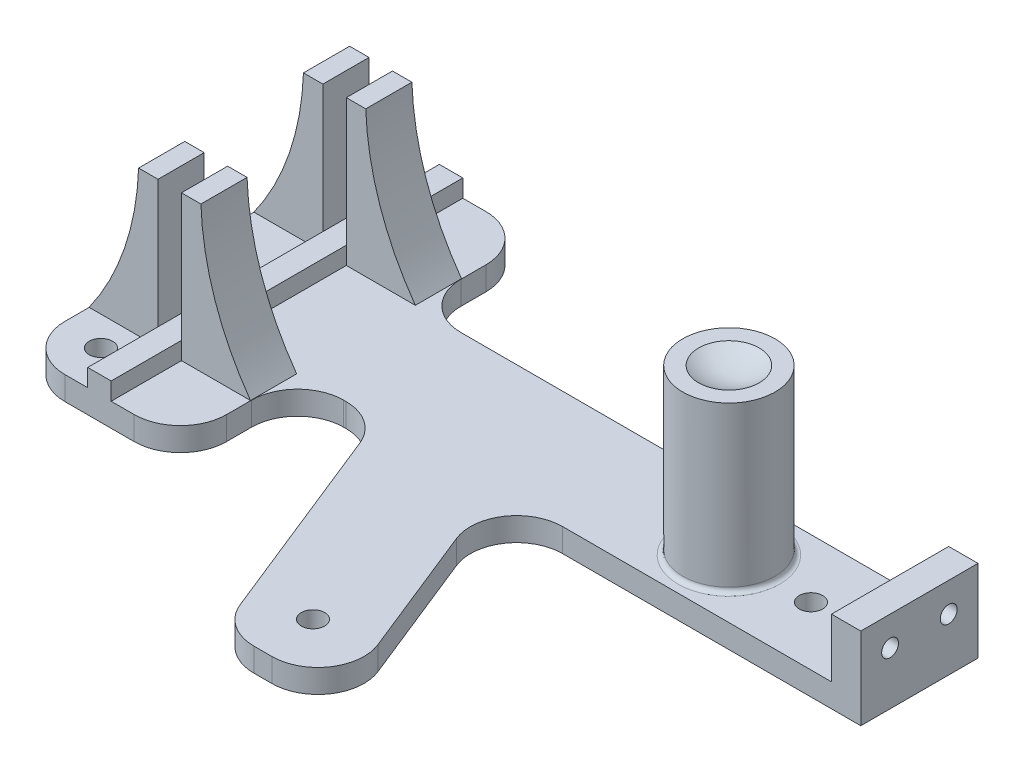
ISO-10303-21;
HEADER;
FILE_DESCRIPTION(('STEP AP214'),'2;1');
FILE_NAME('part.step','',(''),(''),'','','');
FILE_SCHEMA(('AUTOMOTIVE_DESIGN { 1 0 10303 214 1 1 1 1 }'));
ENDSEC;
DATA;
#1=APPLICATION_CONTEXT('core data for automotive mechanical design processes');
#2=APPLICATION_PROTOCOL_DEFINITION('international standard','automotive_design',2000,#1);
#3=PRODUCT_CONTEXT('',#1,'mechanical');
#4=PRODUCT('Part','Part','',(#3));
#5=PRODUCT_RELATED_PRODUCT_CATEGORY('part','',(#4));
#6=PRODUCT_DEFINITION_FORMATION('','',#4);
#7=PRODUCT_DEFINITION_CONTEXT('part definition',#1,'design');
#8=PRODUCT_DEFINITION('design','',#6,#7);
#9=PRODUCT_DEFINITION_SHAPE('','',#8);
#10=(LENGTH_UNIT() NAMED_UNIT(*) SI_UNIT(.MILLI.,.METRE.));
#11=(NAMED_UNIT(*) PLANE_ANGLE_UNIT() SI_UNIT($,.RADIAN.));
#12=(NAMED_UNIT(*) SI_UNIT($,.STERADIAN.) SOLID_ANGLE_UNIT());
#13=UNCERTAINTY_MEASURE_WITH_UNIT(LENGTH_MEASURE(1.E-05),#10,'distance_accuracy_value','');
#14=(GEOMETRIC_REPRESENTATION_CONTEXT(3) GLOBAL_UNCERTAINTY_ASSIGNED_CONTEXT((#13)) GLOBAL_UNIT_ASSIGNED_CONTEXT((#10,
#11,#12)) REPRESENTATION_CONTEXT('',''));
#15=CARTESIAN_POINT('',(0.,0.,0.));
#16=DIRECTION('',(0.,0.,1.));
#17=DIRECTION('',(1.,0.,0.));
#18=AXIS2_PLACEMENT_3D('',#15,#16,#17);
#19=CARTESIAN_POINT('',(30.08,0.,22.7));
#20=DIRECTION('',(0.,1.,0.));
#21=DIRECTION('',(0.,0.,1.));
#22=AXIS2_PLACEMENT_3D('',#19,#20,#21);
#23=PLANE('',#22);
#24=CARTESIAN_POINT('',(-6.03,0.,29.21));
#25=DIRECTION('',(0.,1.,0.));
#26=DIRECTION('',(0.,0.,1.));
#27=AXIS2_PLACEMENT_3D('',#24,#25,#26);
#28=CIRCLE('',#27,2.54);
#29=CARTESIAN_POINT('',(-6.03,0.,31.75));
#30=VERTEX_POINT('',#29);
#31=EDGE_CURVE('E457',#30,#30,#28,.F.);
#32=ORIENTED_EDGE('',*,*,#31,.T.);
#33=EDGE_LOOP('',(#32));
#34=FACE_BOUND('',#33,.T.);
#35=DIRECTION('',(1.,0.,0.));
#36=VECTOR('',#35,1.);
#37=CARTESIAN_POINT('',(-4.92,0.,38.1));
#38=LINE('',#37,#36);
#39=CARTESIAN_POINT('',(-4.92,0.,38.1));
#40=VERTEX_POINT('',#39);
#41=CARTESIAN_POINT('',(0.,0.,38.1));
#42=VERTEX_POINT('',#41);
#43=EDGE_CURVE('E705',#40,#42,#38,.T.);
#44=ORIENTED_EDGE('',*,*,#43,.T.);
#45=DIRECTION('',(0.,0.,1.));
#46=VECTOR('',#45,1.);
#47=CARTESIAN_POINT('',(0.,0.,-38.1));
#48=LINE('',#47,#46);
#49=CARTESIAN_POINT('',(0.,0.,22.86));
#50=VERTEX_POINT('',#49);
#51=EDGE_CURVE('E398',#50,#42,#48,.T.);
#52=ORIENTED_EDGE('',*,*,#51,.F.);
#53=DIRECTION('',(1.,0.,0.));
#54=VECTOR('',#53,1.);
#55=CARTESIAN_POINT('',(0.,0.,22.86));
#56=LINE('',#55,#54);
#57=CARTESIAN_POINT('',(-14.92,0.,22.86));
#58=VERTEX_POINT('',#57);
#59=EDGE_CURVE('E630',#58,#50,#56,.T.);
#60=ORIENTED_EDGE('',*,*,#59,.F.);
#61=DIRECTION('',(0.,0.,1.));
#62=VECTOR('',#61,1.);
#63=CARTESIAN_POINT('',(-14.92,0.,-28.1));
#64=LINE('',#63,#62);
#65=CARTESIAN_POINT('',(-14.92,0.,28.1));
#66=VERTEX_POINT('',#65);
#67=EDGE_CURVE('E694',#58,#66,#64,.T.);
#68=ORIENTED_EDGE('',*,*,#67,.T.);
#69=CARTESIAN_POINT('',(-4.92,0.,28.1));
#70=DIRECTION('',(0.,1.,0.));
#71=DIRECTION('',(0.,0.,1.));
#72=AXIS2_PLACEMENT_3D('',#69,#70,#71);
#73=CIRCLE('',#72,10.);
#74=EDGE_CURVE('E698',#66,#40,#73,.T.);
#75=ORIENTED_EDGE('',*,*,#74,.T.);
#76=EDGE_LOOP('',(#44,#52,#60,#68,#75));
#77=FACE_BOUND('',#76,.T.);
#78=ADVANCED_FACE('F33',(#34,#77),#23,.T.);
#79=DIRECTION('',(1.,0.,0.));
#80=VECTOR('',#79,1.);
#81=CARTESIAN_POINT('',(0.,0.,12.86));
#82=LINE('',#81,#80);
#83=CARTESIAN_POINT('',(-14.92,0.,12.86));
#84=VERTEX_POINT('',#83);
#85=CARTESIAN_POINT('',(0.,0.,12.86));
#86=VERTEX_POINT('',#85);
#87=EDGE_CURVE('E617',#84,#86,#82,.T.);
#88=ORIENTED_EDGE('',*,*,#87,.T.);
#89=CARTESIAN_POINT('',(0.,0.,-12.86));
#90=VERTEX_POINT('',#89);
#91=EDGE_CURVE('E419',#90,#86,#48,.T.);
#92=ORIENTED_EDGE('',*,*,#91,.F.);
#93=DIRECTION('',(1.,0.,0.));
#94=VECTOR('',#93,1.);
#95=CARTESIAN_POINT('',(0.,0.,-12.86));
#96=LINE('',#95,#94);
#97=CARTESIAN_POINT('',(-14.92,0.,-12.86));
#98=VERTEX_POINT('',#97);
#99=EDGE_CURVE('E544',#98,#90,#96,.T.);
#100=ORIENTED_EDGE('',*,*,#99,.F.);
#101=EDGE_CURVE('E700',#98,#84,#64,.T.);
#102=ORIENTED_EDGE('',*,*,#101,.T.);
#103=EDGE_LOOP('',(#88,#92,#100,#102));
#104=FACE_BOUND('',#103,.T.);
#105=ADVANCED_FACE('F862',(#104),#23,.T.);
#106=CARTESIAN_POINT('',(-6.03,0.,-29.21));
#107=DIRECTION('',(0.,1.,0.));
#108=DIRECTION('',(0.,0.,1.));
#109=AXIS2_PLACEMENT_3D('',#106,#107,#108);
#110=CIRCLE('',#109,2.54);
#111=CARTESIAN_POINT('',(-6.03,0.,-26.67));
#112=VERTEX_POINT('',#111);
#113=EDGE_CURVE('E451',#112,#112,#110,.F.);
#114=ORIENTED_EDGE('',*,*,#113,.T.);
#115=EDGE_LOOP('',(#114));
#116=FACE_BOUND('',#115,.T.);
#117=DIRECTION('',(1.,0.,0.));
#118=VECTOR('',#117,1.);
#119=CARTESIAN_POINT('',(0.,0.,-22.86));
#120=LINE('',#119,#118);
#121=CARTESIAN_POINT('',(-14.92,0.,-22.86));
#122=VERTEX_POINT('',#121);
#123=CARTESIAN_POINT('',(0.,0.,-22.86));
#124=VERTEX_POINT('',#123);
#125=EDGE_CURVE('E557',#122,#124,#120,.T.);
#126=ORIENTED_EDGE('',*,*,#125,.T.);
#127=CARTESIAN_POINT('',(0.,0.,-38.1));
#128=VERTEX_POINT('',#127);
#129=EDGE_CURVE('E415',#128,#124,#48,.T.);
#130=ORIENTED_EDGE('',*,*,#129,.F.);
#131=DIRECTION('',(-1.,0.,0.));
#132=VECTOR('',#131,1.);
#133=CARTESIAN_POINT('',(-4.92,0.,-38.1));
#134=LINE('',#133,#132);
#135=CARTESIAN_POINT('',(-4.91999999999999,0.,-38.1));
#136=VERTEX_POINT('',#135);
#137=EDGE_CURVE('E688',#128,#136,#134,.T.);
#138=ORIENTED_EDGE('',*,*,#137,.T.);
#139=CARTESIAN_POINT('',(-4.92,0.,-28.1));
#140=DIRECTION('',(0.,1.,0.));
#141=DIRECTION('',(0.,0.,1.));
#142=AXIS2_PLACEMENT_3D('',#139,#140,#141);
#143=CIRCLE('',#142,10.);
#144=CARTESIAN_POINT('',(-14.92,0.,-28.1));
#145=VERTEX_POINT('',#144);
#146=EDGE_CURVE('E691',#136,#145,#143,.T.);
#147=ORIENTED_EDGE('',*,*,#146,.T.);
#148=EDGE_CURVE('E695',#145,#122,#64,.T.);
#149=ORIENTED_EDGE('',*,*,#148,.T.);
#150=EDGE_LOOP('',(#126,#130,#138,#147,#149));
#151=FACE_BOUND('',#150,.T.);
#152=ADVANCED_FACE('F868',(#116,#151),#23,.T.);
#153=CARTESIAN_POINT('',(100.84,0.,0.));
#154=DIRECTION('',(0.,1.,0.));
#155=DIRECTION('',(0.,0.,1.));
#156=AXIS2_PLACEMENT_3D('',#153,#154,#155);
#157=CIRCLE('',#156,11.);
#158=CARTESIAN_POINT('',(100.84,0.,11.));
#159=VERTEX_POINT('',#158);
#160=EDGE_CURVE('E746',#159,#159,#157,.F.);
#161=ORIENTED_EDGE('',*,*,#160,.T.);
#162=EDGE_LOOP('',(#161));
#163=FACE_BOUND('',#162,.T.);
#164=CARTESIAN_POINT('',(67.8645239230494,0.,57.15));
#165=DIRECTION('',(0.,1.,0.));
#166=DIRECTION('',(0.,0.,1.));
#167=AXIS2_PLACEMENT_3D('',#164,#165,#166);
#168=CIRCLE('',#167,2.54);
#169=CARTESIAN_POINT('',(67.8645239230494,0.,59.69));
#170=VERTEX_POINT('',#169);
#171=EDGE_CURVE('E445',#170,#170,#168,.F.);
#172=ORIENTED_EDGE('',*,*,#171,.T.);
#173=EDGE_LOOP('',(#172));
#174=FACE_BOUND('',#173,.T.);
#175=CARTESIAN_POINT('',(118.62,0.,0.));
#176=DIRECTION('',(0.,1.,0.));
#177=DIRECTION('',(0.,0.,1.));
#178=AXIS2_PLACEMENT_3D('',#175,#176,#177);
#179=CIRCLE('',#178,2.54);
#180=CARTESIAN_POINT('',(118.62,0.,2.54));
#181=VERTEX_POINT('',#180);
#182=EDGE_CURVE('E441',#181,#181,#179,.F.);
#183=ORIENTED_EDGE('',*,*,#182,.T.);
#184=EDGE_LOOP('',(#183));
#185=FACE_BOUND('',#184,.T.);
#186=CARTESIAN_POINT('',(10.08,0.,-38.1));
#187=VERTEX_POINT('',#186);
#188=CARTESIAN_POINT('',(5.08000000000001,0.,-38.1));
#189=VERTEX_POINT('',#188);
#190=EDGE_CURVE('E689',#187,#189,#134,.T.);
#191=ORIENTED_EDGE('',*,*,#190,.T.);
#192=DIRECTION('',(0.,0.,-1.));
#193=VECTOR('',#192,1.);
#194=CARTESIAN_POINT('',(5.08,0.,-38.1));
#195=LINE('',#194,#193);
#196=CARTESIAN_POINT('',(5.08,0.,-22.86));
#197=VERTEX_POINT('',#196);
#198=EDGE_CURVE('E418',#197,#189,#195,.T.);
#199=ORIENTED_EDGE('',*,*,#198,.F.);
#200=DIRECTION('',(1.,0.,0.));
#201=VECTOR('',#200,1.);
#202=CARTESIAN_POINT('',(5.08,0.,-22.86));
#203=LINE('',#202,#201);
#204=CARTESIAN_POINT('',(20.033299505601,0.,-22.86));
#205=VERTEX_POINT('',#204);
#206=EDGE_CURVE('E516',#197,#205,#203,.T.);
#207=ORIENTED_EDGE('',*,*,#206,.T.);
#208=DIRECTION('',(0.,0.,-1.));
#209=VECTOR('',#208,1.);
#210=CARTESIAN_POINT('',(20.033299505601,0.,-12.86));
#211=LINE('',#210,#209);
#212=CARTESIAN_POINT('',(20.033299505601,0.,-12.86));
#213=VERTEX_POINT('',#212);
#214=EDGE_CURVE('E532',#213,#205,#211,.T.);
#215=ORIENTED_EDGE('',*,*,#214,.F.);
#216=DIRECTION('',(1.,0.,0.));
#217=VECTOR('',#216,1.);
#218=CARTESIAN_POINT('',(5.08,0.,-12.86));
#219=LINE('',#218,#217);
#220=CARTESIAN_POINT('',(5.08,0.,-12.86));
#221=VERTEX_POINT('',#220);
#222=EDGE_CURVE('E520',#221,#213,#219,.T.);
#223=ORIENTED_EDGE('',*,*,#222,.F.);
#224=CARTESIAN_POINT('',(5.08,0.,12.86));
#225=VERTEX_POINT('',#224);
#226=EDGE_CURVE('E421',#225,#221,#195,.T.);
#227=ORIENTED_EDGE('',*,*,#226,.F.);
#228=DIRECTION('',(1.,0.,0.));
#229=VECTOR('',#228,1.);
#230=CARTESIAN_POINT('',(5.08,0.,12.86));
#231=LINE('',#230,#229);
#232=CARTESIAN_POINT('',(20.033299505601,0.,12.86));
#233=VERTEX_POINT('',#232);
#234=EDGE_CURVE('E577',#225,#233,#231,.T.);
#235=ORIENTED_EDGE('',*,*,#234,.T.);
#236=DIRECTION('',(0.,0.,1.));
#237=VECTOR('',#236,1.);
#238=CARTESIAN_POINT('',(20.033299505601,0.,12.86));
#239=LINE('',#238,#237);
#240=CARTESIAN_POINT('',(20.033299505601,0.,22.86));
#241=VERTEX_POINT('',#240);
#242=EDGE_CURVE('E586',#233,#241,#239,.T.);
#243=ORIENTED_EDGE('',*,*,#242,.T.);
#244=DIRECTION('',(1.,0.,0.));
#245=VECTOR('',#244,1.);
#246=CARTESIAN_POINT('',(5.08,0.,22.86));
#247=LINE('',#246,#245);
#248=CARTESIAN_POINT('',(5.08,0.,22.86));
#249=VERTEX_POINT('',#248);
#250=EDGE_CURVE('E589',#249,#241,#247,.T.);
#251=ORIENTED_EDGE('',*,*,#250,.F.);
#252=CARTESIAN_POINT('',(5.08000000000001,0.,38.1));
#253=VERTEX_POINT('',#252);
#254=EDGE_CURVE('E57',#253,#249,#195,.T.);
#255=ORIENTED_EDGE('',*,*,#254,.F.);
#256=CARTESIAN_POINT('',(10.08,0.,38.1));
#257=VERTEX_POINT('',#256);
#258=EDGE_CURVE('E704',#253,#257,#38,.T.);
#259=ORIENTED_EDGE('',*,*,#258,.T.);
#260=CARTESIAN_POINT('',(10.08,0.,28.1));
#261=DIRECTION('',(0.,1.,0.));
#262=DIRECTION('',(0.,0.,-1.));
#263=AXIS2_PLACEMENT_3D('',#260,#261,#262);
#264=CIRCLE('',#263,10.);
#265=CARTESIAN_POINT('',(20.08,0.,28.1));
#266=VERTEX_POINT('',#265);
#267=EDGE_CURVE('E707',#257,#266,#264,.T.);
#268=ORIENTED_EDGE('',*,*,#267,.T.);
#269=DIRECTION('',(0.,0.,-1.));
#270=VECTOR('',#269,1.);
#271=CARTESIAN_POINT('',(20.08,0.,28.1));
#272=LINE('',#271,#270);
#273=CARTESIAN_POINT('',(20.08,0.,22.7));
#274=VERTEX_POINT('',#273);
#275=EDGE_CURVE('E710',#266,#274,#272,.T.);
#276=ORIENTED_EDGE('',*,*,#275,.T.);
#277=CARTESIAN_POINT('',(30.08,0.,22.7));
#278=DIRECTION('',(0.,-1.,0.));
#279=DIRECTION('',(0.,0.,1.));
#280=AXIS2_PLACEMENT_3D('',#277,#278,#279);
#281=CIRCLE('',#280,10.);
#282=CARTESIAN_POINT('',(30.08,0.,12.7));
#283=VERTEX_POINT('',#282);
#284=EDGE_CURVE('E362',#274,#283,#281,.T.);
#285=ORIENTED_EDGE('',*,*,#284,.T.);
#286=DIRECTION('',(1.,0.,0.));
#287=VECTOR('',#286,1.);
#288=CARTESIAN_POINT('',(30.08,0.,12.7));
#289=LINE('',#288,#287);
#290=CARTESIAN_POINT('',(30.5759629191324,0.,12.7));
#291=VERTEX_POINT('',#290);
#292=EDGE_CURVE('E361',#283,#291,#289,.T.);
#293=ORIENTED_EDGE('',*,*,#292,.T.);
#294=CARTESIAN_POINT('',(30.5759629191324,0.,22.7));
#295=DIRECTION('',(0.,1.,0.));
#296=DIRECTION('',(0.,0.,1.));
#297=AXIS2_PLACEMENT_3D('',#294,#295,#296);
#298=CIRCLE('',#297,10.);
#299=CARTESIAN_POINT('',(39.8575205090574,0.,18.9780799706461));
#300=VERTEX_POINT('',#299);
#301=EDGE_CURVE('E42',#291,#300,#298,.F.);
#302=ORIENTED_EDGE('',*,*,#301,.T.);
#303=DIRECTION('',(0.372192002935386,0.,0.928155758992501));
#304=VECTOR('',#303,1.);
#305=CARTESIAN_POINT('',(37.34,0.,12.7));
#306=LINE('',#305,#304);
#307=CARTESIAN_POINT('',(57.2304524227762,0.,62.3019200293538));
#308=VERTEX_POINT('',#307);
#309=EDGE_CURVE('E463',#300,#308,#306,.T.);
#310=ORIENTED_EDGE('',*,*,#309,.T.);
#311=CARTESIAN_POINT('',(66.5120100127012,0.,58.58));
#312=DIRECTION('',(0.,1.,0.));
#313=DIRECTION('',(0.,0.,1.));
#314=AXIS2_PLACEMENT_3D('',#311,#312,#313);
#315=CIRCLE('',#314,10.);
#316=CARTESIAN_POINT('',(66.5120100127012,0.,68.58));
#317=VERTEX_POINT('',#316);
#318=EDGE_CURVE('E483',#308,#317,#315,.T.);
#319=ORIENTED_EDGE('',*,*,#318,.T.);
#320=DIRECTION('',(1.,0.,0.));
#321=VECTOR('',#320,1.);
#322=CARTESIAN_POINT('',(70.3639025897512,0.,68.58));
#323=LINE('',#322,#321);
#324=CARTESIAN_POINT('',(70.3639025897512,0.,68.58));
#325=VERTEX_POINT('',#324);
#326=EDGE_CURVE('E486',#317,#325,#323,.T.);
#327=ORIENTED_EDGE('',*,*,#326,.T.);
#328=CARTESIAN_POINT('',(70.3639025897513,0.,58.58));
#329=DIRECTION('',(0.,1.,0.));
#330=DIRECTION('',(0.,0.,-1.));
#331=AXIS2_PLACEMENT_3D('',#328,#329,#330);
#332=CIRCLE('',#331,10.);
#333=CARTESIAN_POINT('',(79.6454601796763,0.,54.858079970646));
#334=VERTEX_POINT('',#333);
#335=EDGE_CURVE('E489',#325,#334,#332,.T.);
#336=ORIENTED_EDGE('',*,*,#335,.T.);
#337=DIRECTION('',(-0.372192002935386,0.,-0.928155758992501));
#338=VECTOR('',#337,1.);
#339=CARTESIAN_POINT('',(62.74,0.,12.7));
#340=LINE('',#339,#338);
#341=CARTESIAN_POINT('',(68.2425127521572,0.,26.4219200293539));
#342=VERTEX_POINT('',#341);
#343=EDGE_CURVE('E469',#334,#342,#340,.T.);
#344=ORIENTED_EDGE('',*,*,#343,.T.);
#345=CARTESIAN_POINT('',(77.5240703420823,0.,22.7));
#346=DIRECTION('',(0.,1.,0.));
#347=DIRECTION('',(0.,0.,1.));
#348=AXIS2_PLACEMENT_3D('',#345,#346,#347);
#349=CIRCLE('',#348,10.);
#350=CARTESIAN_POINT('',(77.5240703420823,0.,12.7));
#351=VERTEX_POINT('',#350);
#352=EDGE_CURVE('E358',#342,#351,#349,.F.);
#353=ORIENTED_EDGE('',*,*,#352,.T.);
#354=CARTESIAN_POINT('',(135.765,0.,12.7));
#355=VERTEX_POINT('',#354);
#356=EDGE_CURVE('E354',#351,#355,#289,.T.);
#357=ORIENTED_EDGE('',*,*,#356,.T.);
#358=DIRECTION('',(0.,0.,-1.));
#359=VECTOR('',#358,1.);
#360=CARTESIAN_POINT('',(135.765,0.,-12.7));
#361=LINE('',#360,#359);
#362=CARTESIAN_POINT('',(135.765,0.,-12.7));
#363=VERTEX_POINT('',#362);
#364=EDGE_CURVE('E356',#355,#363,#361,.T.);
#365=ORIENTED_EDGE('',*,*,#364,.T.);
#366=DIRECTION('',(-1.,0.,0.));
#367=VECTOR('',#366,1.);
#368=CARTESIAN_POINT('',(30.08,0.,-12.7));
#369=LINE('',#368,#367);
#370=CARTESIAN_POINT('',(30.08,0.,-12.7));
#371=VERTEX_POINT('',#370);
#372=EDGE_CURVE('E633',#363,#371,#369,.T.);
#373=ORIENTED_EDGE('',*,*,#372,.T.);
#374=CARTESIAN_POINT('',(30.08,0.,-22.7));
#375=DIRECTION('',(0.,-1.,0.));
#376=DIRECTION('',(0.,0.,1.));
#377=AXIS2_PLACEMENT_3D('',#374,#375,#376);
#378=CIRCLE('',#377,10.);
#379=CARTESIAN_POINT('',(20.08,0.,-22.7));
#380=VERTEX_POINT('',#379);
#381=EDGE_CURVE('E679',#371,#380,#378,.T.);
#382=ORIENTED_EDGE('',*,*,#381,.T.);
#383=DIRECTION('',(0.,0.,-1.));
#384=VECTOR('',#383,1.);
#385=CARTESIAN_POINT('',(20.08,0.,-28.1));
#386=LINE('',#385,#384);
#387=CARTESIAN_POINT('',(20.08,0.,-28.1));
#388=VERTEX_POINT('',#387);
#389=EDGE_CURVE('E682',#380,#388,#386,.T.);
#390=ORIENTED_EDGE('',*,*,#389,.T.);
#391=CARTESIAN_POINT('',(10.08,0.,-28.1));
#392=DIRECTION('',(0.,1.,0.));
#393=DIRECTION('',(0.,0.,1.));
#394=AXIS2_PLACEMENT_3D('',#391,#392,#393);
#395=CIRCLE('',#394,10.);
#396=EDGE_CURVE('E685',#388,#187,#395,.T.);
#397=ORIENTED_EDGE('',*,*,#396,.T.);
#398=EDGE_LOOP('',(#191,#199,#207,#215,#223,#227,#235,#243,#251,#255,#259,#268,#276,#285,#293,
#302,#310,#319,#327,#336,#344,#353,#357,#365,#373,#382,#390,#397));
#399=FACE_BOUND('',#398,.T.);
#400=ADVANCED_FACE('F355',(#163,#174,#185,#399),#23,.T.);
#401=CARTESIAN_POINT('',(30.08,-5.08,12.7));
#402=DIRECTION('',(0.,0.,1.));
#403=DIRECTION('',(1.,0.,0.));
#404=AXIS2_PLACEMENT_3D('',#401,#402,#403);
#405=PLANE('',#404);
#406=DIRECTION('',(0.,1.,0.));
#407=VECTOR('',#406,1.);
#408=CARTESIAN_POINT('',(135.765,0.,12.7));
#409=LINE('',#408,#407);
#410=CARTESIAN_POINT('',(135.765,12.7,12.7));
#411=VERTEX_POINT('',#410);
#412=EDGE_CURVE('E49',#355,#411,#409,.T.);
#413=ORIENTED_EDGE('',*,*,#412,.F.);
#414=ORIENTED_EDGE('',*,*,#356,.F.);
#415=DIRECTION('',(0.,1.,0.));
#416=VECTOR('',#415,1.);
#417=CARTESIAN_POINT('',(77.5240703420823,-5.08,12.7));
#418=LINE('',#417,#416);
#419=CARTESIAN_POINT('',(77.5240703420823,-5.08,12.7));
#420=VERTEX_POINT('',#419);
#421=EDGE_CURVE('E752',#351,#420,#418,.F.);
#422=ORIENTED_EDGE('',*,*,#421,.T.);
#423=DIRECTION('',(1.,0.,0.));
#424=VECTOR('',#423,1.);
#425=CARTESIAN_POINT('',(132.59,-5.08,12.7));
#426=LINE('',#425,#424);
#427=CARTESIAN_POINT('',(142.115,-5.08,12.7));
#428=VERTEX_POINT('',#427);
#429=EDGE_CURVE('E642',#420,#428,#426,.T.);
#430=ORIENTED_EDGE('',*,*,#429,.T.);
#431=DIRECTION('',(0.,1.,0.));
#432=VECTOR('',#431,1.);
#433=CARTESIAN_POINT('',(142.115,-5.08,12.7));
#434=LINE('',#433,#432);
#435=CARTESIAN_POINT('',(142.115,12.7,12.7));
#436=VERTEX_POINT('',#435);
#437=EDGE_CURVE('E392',#428,#436,#434,.T.);
#438=ORIENTED_EDGE('',*,*,#437,.T.);
#439=DIRECTION('',(1.,0.,0.));
#440=VECTOR('',#439,1.);
#441=CARTESIAN_POINT('',(132.59,12.7,12.7));
#442=LINE('',#441,#440);
#443=EDGE_CURVE('E374',#411,#436,#442,.T.);
#444=ORIENTED_EDGE('',*,*,#443,.F.);
#445=EDGE_LOOP('',(#413,#414,#422,#430,#438,#444));
#446=FACE_BOUND('',#445,.T.);
#447=ADVANCED_FACE('F372',(#446),#405,.T.);
#448=CARTESIAN_POINT('',(30.08,-5.08,12.7));
#449=VERTEX_POINT('',#448);
#450=CARTESIAN_POINT('',(30.5759629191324,-5.08,12.7));
#451=VERTEX_POINT('',#450);
#452=EDGE_CURVE('E638',#449,#451,#426,.T.);
#453=ORIENTED_EDGE('',*,*,#452,.T.);
#454=DIRECTION('',(0.,1.,0.));
#455=VECTOR('',#454,1.);
#456=CARTESIAN_POINT('',(30.5759629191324,0.,12.7));
#457=LINE('',#456,#455);
#458=EDGE_CURVE('E757',#451,#291,#457,.T.);
#459=ORIENTED_EDGE('',*,*,#458,.T.);
#460=ORIENTED_EDGE('',*,*,#292,.F.);
#461=DIRECTION('',(0.,1.,0.));
#462=VECTOR('',#461,1.);
#463=CARTESIAN_POINT('',(30.08,-5.08,12.7));
#464=LINE('',#463,#462);
#465=EDGE_CURVE('E716',#449,#283,#464,.T.);
#466=ORIENTED_EDGE('',*,*,#465,.F.);
#467=EDGE_LOOP('',(#453,#459,#460,#466));
#468=FACE_BOUND('',#467,.T.);
#469=ADVANCED_FACE('F779',(#468),#405,.T.);
#470=CARTESIAN_POINT('',(30.08,-5.08,22.7));
#471=DIRECTION('',(0.,1.,0.));
#472=DIRECTION('',(0.,0.,1.));
#473=AXIS2_PLACEMENT_3D('',#470,#471,#472);
#474=CYLINDRICAL_SURFACE('',#473,10.);
#475=ORIENTED_EDGE('',*,*,#284,.F.);
#476=DIRECTION('',(0.,1.,0.));
#477=VECTOR('',#476,1.);
#478=CARTESIAN_POINT('',(20.08,-5.08,22.7));
#479=LINE('',#478,#477);
#480=CARTESIAN_POINT('',(20.08,-5.08,22.7));
#481=VERTEX_POINT('',#480);
#482=EDGE_CURVE('E718',#481,#274,#479,.T.);
#483=ORIENTED_EDGE('',*,*,#482,.F.);
#484=CARTESIAN_POINT('',(30.08,-5.08,22.7));
#485=DIRECTION('',(0.,-1.,0.));
#486=DIRECTION('',(0.,0.,1.));
#487=AXIS2_PLACEMENT_3D('',#484,#485,#486);
#488=CIRCLE('',#487,10.);
#489=EDGE_CURVE('E674',#481,#449,#488,.T.);
#490=ORIENTED_EDGE('',*,*,#489,.T.);
#491=ORIENTED_EDGE('',*,*,#465,.T.);
#492=EDGE_LOOP('',(#475,#483,#490,#491));
#493=FACE_BOUND('',#492,.T.);
#494=ADVANCED_FACE('F782',(#493),#474,.F.);
#495=CARTESIAN_POINT('',(20.08,-5.08,28.1));
#496=DIRECTION('',(1.,0.,0.));
#497=DIRECTION('',(0.,0.,-1.));
#498=AXIS2_PLACEMENT_3D('',#495,#496,#497);
#499=PLANE('',#498);
#500=ORIENTED_EDGE('',*,*,#275,.F.);
#501=DIRECTION('',(0.,1.,0.));
#502=VECTOR('',#501,1.);
#503=CARTESIAN_POINT('',(20.08,-5.08,28.1));
#504=LINE('',#503,#502);
#505=CARTESIAN_POINT('',(20.08,-5.08,28.1));
#506=VERTEX_POINT('',#505);
#507=EDGE_CURVE('E720',#506,#266,#504,.T.);
#508=ORIENTED_EDGE('',*,*,#507,.F.);
#509=DIRECTION('',(0.,0.,-1.));
#510=VECTOR('',#509,1.);
#511=CARTESIAN_POINT('',(20.08,-5.08,28.1));
#512=LINE('',#511,#510);
#513=EDGE_CURVE('E671',#506,#481,#512,.T.);
#514=ORIENTED_EDGE('',*,*,#513,.T.);
#515=ORIENTED_EDGE('',*,*,#482,.T.);
#516=EDGE_LOOP('',(#500,#508,#514,#515));
#517=FACE_BOUND('',#516,.T.);
#518=ADVANCED_FACE('F787',(#517),#499,.T.);
#519=CARTESIAN_POINT('',(10.08,-5.08,28.1));
#520=DIRECTION('',(0.,1.,0.));
#521=DIRECTION('',(0.,0.,1.));
#522=AXIS2_PLACEMENT_3D('',#519,#520,#521);
#523=CYLINDRICAL_SURFACE('',#522,10.);
#524=ORIENTED_EDGE('',*,*,#267,.F.);
#525=DIRECTION('',(0.,1.,0.));
#526=VECTOR('',#525,1.);
#527=CARTESIAN_POINT('',(10.08,-5.08,38.1));
#528=LINE('',#527,#526);
#529=CARTESIAN_POINT('',(10.08,-5.08,38.1));
#530=VERTEX_POINT('',#529);
#531=EDGE_CURVE('E722',#530,#257,#528,.T.);
#532=ORIENTED_EDGE('',*,*,#531,.F.);
#533=CARTESIAN_POINT('',(10.08,-5.08,28.1));
#534=DIRECTION('',(0.,1.,0.));
#535=DIRECTION('',(0.,0.,-1.));
#536=AXIS2_PLACEMENT_3D('',#533,#534,#535);
#537=CIRCLE('',#536,10.);
#538=EDGE_CURVE('E668',#530,#506,#537,.T.);
#539=ORIENTED_EDGE('',*,*,#538,.T.);
#540=ORIENTED_EDGE('',*,*,#507,.T.);
#541=EDGE_LOOP('',(#524,#532,#539,#540));
#542=FACE_BOUND('',#541,.T.);
#543=ADVANCED_FACE('F790',(#542),#523,.T.);
#544=CARTESIAN_POINT('',(-4.92,-5.08,38.1));
#545=DIRECTION('',(0.,0.,1.));
#546=DIRECTION('',(1.,0.,0.));
#547=AXIS2_PLACEMENT_3D('',#544,#545,#546);
#548=PLANE('',#547);
#549=ORIENTED_EDGE('',*,*,#43,.F.);
#550=DIRECTION('',(0.,1.,0.));
#551=VECTOR('',#550,1.);
#552=CARTESIAN_POINT('',(-4.92,-5.08,38.1));
#553=LINE('',#552,#551);
#554=CARTESIAN_POINT('',(-4.92,-5.08,38.1));
#555=VERTEX_POINT('',#554);
#556=EDGE_CURVE('E725',#555,#40,#553,.T.);
#557=ORIENTED_EDGE('',*,*,#556,.F.);
#558=DIRECTION('',(1.,0.,0.));
#559=VECTOR('',#558,1.);
#560=CARTESIAN_POINT('',(-4.92,-5.08,38.1));
#561=LINE('',#560,#559);
#562=EDGE_CURVE('E665',#555,#530,#561,.T.);
#563=ORIENTED_EDGE('',*,*,#562,.T.);
#564=ORIENTED_EDGE('',*,*,#531,.T.);
#565=ORIENTED_EDGE('',*,*,#258,.F.);
#566=DIRECTION('',(0.,-1.,0.));
#567=VECTOR('',#566,1.);
#568=CARTESIAN_POINT('',(5.08000000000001,3.81,38.1));
#569=LINE('',#568,#567);
#570=CARTESIAN_POINT('',(5.08000000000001,3.81,38.1));
#571=VERTEX_POINT('',#570);
#572=EDGE_CURVE('E427',#571,#253,#569,.T.);
#573=ORIENTED_EDGE('',*,*,#572,.F.);
#574=DIRECTION('',(1.,0.,0.));
#575=VECTOR('',#574,1.);
#576=CARTESIAN_POINT('',(0.,3.81,38.1));
#577=LINE('',#576,#575);
#578=CARTESIAN_POINT('',(0.,3.81,38.1));
#579=VERTEX_POINT('',#578);
#580=EDGE_CURVE('E403',#579,#571,#577,.T.);
#581=ORIENTED_EDGE('',*,*,#580,.F.);
#582=DIRECTION('',(0.,-1.,0.));
#583=VECTOR('',#582,1.);
#584=CARTESIAN_POINT('',(0.,3.81,38.1));
#585=LINE('',#584,#583);
#586=EDGE_CURVE('E430',#579,#42,#585,.T.);
#587=ORIENTED_EDGE('',*,*,#586,.T.);
#588=EDGE_LOOP('',(#549,#557,#563,#564,#565,#573,#581,#587));
#589=FACE_BOUND('',#588,.T.);
#590=ADVANCED_FACE('F795',(#589),#548,.T.);
#591=CARTESIAN_POINT('',(-4.92,-5.08,28.1));
#592=DIRECTION('',(0.,1.,0.));
#593=DIRECTION('',(0.,0.,1.));
#594=AXIS2_PLACEMENT_3D('',#591,#592,#593);
#595=CYLINDRICAL_SURFACE('',#594,10.);
#596=ORIENTED_EDGE('',*,*,#74,.F.);
#597=DIRECTION('',(0.,1.,0.));
#598=VECTOR('',#597,1.);
#599=CARTESIAN_POINT('',(-14.92,-5.08,28.1));
#600=LINE('',#599,#598);
#601=CARTESIAN_POINT('',(-14.92,-5.08,28.1));
#602=VERTEX_POINT('',#601);
#603=EDGE_CURVE('E727',#602,#66,#600,.T.);
#604=ORIENTED_EDGE('',*,*,#603,.F.);
#605=CARTESIAN_POINT('',(-4.92,-5.08,28.1));
#606=DIRECTION('',(0.,1.,0.));
#607=DIRECTION('',(0.,0.,1.));
#608=AXIS2_PLACEMENT_3D('',#605,#606,#607);
#609=CIRCLE('',#608,10.);
#610=EDGE_CURVE('E662',#602,#555,#609,.T.);
#611=ORIENTED_EDGE('',*,*,#610,.T.);
#612=ORIENTED_EDGE('',*,*,#556,.T.);
#613=EDGE_LOOP('',(#596,#604,#611,#612));
#614=FACE_BOUND('',#613,.T.);
#615=ADVANCED_FACE('F798',(#614),#595,.T.);
#616=CARTESIAN_POINT('',(-14.92,-5.08,-28.1));
#617=DIRECTION('',(-1.,0.,0.));
#618=DIRECTION('',(0.,0.,1.));
#619=AXIS2_PLACEMENT_3D('',#616,#617,#618);
#620=PLANE('',#619);
#621=ORIENTED_EDGE('',*,*,#148,.F.);
#622=DIRECTION('',(0.,1.,0.));
#623=VECTOR('',#622,1.);
#624=CARTESIAN_POINT('',(-14.92,-5.08,-28.1));
#625=LINE('',#624,#623);
#626=CARTESIAN_POINT('',(-14.92,-5.08,-28.1));
#627=VERTEX_POINT('',#626);
#628=EDGE_CURVE('E730',#627,#145,#625,.T.);
#629=ORIENTED_EDGE('',*,*,#628,.F.);
#630=DIRECTION('',(0.,0.,1.));
#631=VECTOR('',#630,1.);
#632=CARTESIAN_POINT('',(-14.92,-5.08,-28.1));
#633=LINE('',#632,#631);
#634=EDGE_CURVE('E659',#627,#602,#633,.T.);
#635=ORIENTED_EDGE('',*,*,#634,.T.);
#636=ORIENTED_EDGE('',*,*,#603,.T.);
#637=ORIENTED_EDGE('',*,*,#67,.F.);
#638=EDGE_CURVE('E701',#84,#58,#64,.T.);
#639=ORIENTED_EDGE('',*,*,#638,.F.);
#640=ORIENTED_EDGE('',*,*,#101,.F.);
#641=EDGE_CURVE('E699',#122,#98,#64,.T.);
#642=ORIENTED_EDGE('',*,*,#641,.F.);
#643=EDGE_LOOP('',(#621,#629,#635,#636,#637,#639,#640,#642));
#644=FACE_BOUND('',#643,.T.);
#645=ADVANCED_FACE('F803',(#644),#620,.T.);
#646=CARTESIAN_POINT('',(-4.92,-5.08,-28.1));
#647=DIRECTION('',(0.,1.,0.));
#648=DIRECTION('',(0.,0.,1.));
#649=AXIS2_PLACEMENT_3D('',#646,#647,#648);
#650=CYLINDRICAL_SURFACE('',#649,10.);
#651=ORIENTED_EDGE('',*,*,#146,.F.);
#652=DIRECTION('',(0.,1.,0.));
#653=VECTOR('',#652,1.);
#654=CARTESIAN_POINT('',(-4.91999999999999,-5.08,-38.1));
#655=LINE('',#654,#653);
#656=CARTESIAN_POINT('',(-4.91999999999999,-5.08,-38.1));
#657=VERTEX_POINT('',#656);
#658=EDGE_CURVE('E732',#657,#136,#655,.T.);
#659=ORIENTED_EDGE('',*,*,#658,.F.);
#660=CARTESIAN_POINT('',(-4.92,-5.08,-28.1));
#661=DIRECTION('',(0.,1.,0.));
#662=DIRECTION('',(0.,0.,1.));
#663=AXIS2_PLACEMENT_3D('',#660,#661,#662);
#664=CIRCLE('',#663,10.);
#665=EDGE_CURVE('E656',#657,#627,#664,.T.);
#666=ORIENTED_EDGE('',*,*,#665,.T.);
#667=ORIENTED_EDGE('',*,*,#628,.T.);
#668=EDGE_LOOP('',(#651,#659,#666,#667));
#669=FACE_BOUND('',#668,.T.);
#670=ADVANCED_FACE('F807',(#669),#650,.T.);
#671=CARTESIAN_POINT('',(-4.92,-5.08,-38.1));
#672=DIRECTION('',(0.,0.,-1.));
#673=DIRECTION('',(-1.,0.,0.));
#674=AXIS2_PLACEMENT_3D('',#671,#672,#673);
#675=PLANE('',#674);
#676=ORIENTED_EDGE('',*,*,#190,.F.);
#677=DIRECTION('',(0.,1.,0.));
#678=VECTOR('',#677,1.);
#679=CARTESIAN_POINT('',(10.08,-5.08,-38.1));
#680=LINE('',#679,#678);
#681=CARTESIAN_POINT('',(10.08,-5.08,-38.1));
#682=VERTEX_POINT('',#681);
#683=EDGE_CURVE('E735',#682,#187,#680,.T.);
#684=ORIENTED_EDGE('',*,*,#683,.F.);
#685=DIRECTION('',(-1.,0.,0.));
#686=VECTOR('',#685,1.);
#687=CARTESIAN_POINT('',(-4.92,-5.08,-38.1));
#688=LINE('',#687,#686);
#689=EDGE_CURVE('E653',#682,#657,#688,.T.);
#690=ORIENTED_EDGE('',*,*,#689,.T.);
#691=ORIENTED_EDGE('',*,*,#658,.T.);
#692=ORIENTED_EDGE('',*,*,#137,.F.);
#693=DIRECTION('',(0.,-1.,0.));
#694=VECTOR('',#693,1.);
#695=CARTESIAN_POINT('',(0.,3.81,-38.1));
#696=LINE('',#695,#694);
#697=CARTESIAN_POINT('',(0.,3.81,-38.1));
#698=VERTEX_POINT('',#697);
#699=EDGE_CURVE('E414',#698,#128,#696,.T.);
#700=ORIENTED_EDGE('',*,*,#699,.F.);
#701=DIRECTION('',(-1.,0.,0.));
#702=VECTOR('',#701,1.);
#703=CARTESIAN_POINT('',(0.,3.81,-38.1));
#704=LINE('',#703,#702);
#705=CARTESIAN_POINT('',(5.08,3.81,-38.1));
#706=VERTEX_POINT('',#705);
#707=EDGE_CURVE('E411',#706,#698,#704,.T.);
#708=ORIENTED_EDGE('',*,*,#707,.F.);
#709=DIRECTION('',(0.,-1.,0.));
#710=VECTOR('',#709,1.);
#711=CARTESIAN_POINT('',(5.08,3.81,-38.1));
#712=LINE('',#711,#710);
#713=EDGE_CURVE('E424',#706,#189,#712,.T.);
#714=ORIENTED_EDGE('',*,*,#713,.T.);
#715=EDGE_LOOP('',(#676,#684,#690,#691,#692,#700,#708,#714));
#716=FACE_BOUND('',#715,.T.);
#717=ADVANCED_FACE('F812',(#716),#675,.T.);
#718=CARTESIAN_POINT('',(10.08,-5.08,-28.1));
#719=DIRECTION('',(0.,1.,0.));
#720=DIRECTION('',(0.,0.,1.));
#721=AXIS2_PLACEMENT_3D('',#718,#719,#720);
#722=CYLINDRICAL_SURFACE('',#721,10.);
#723=ORIENTED_EDGE('',*,*,#396,.F.);
#724=DIRECTION('',(0.,1.,0.));
#725=VECTOR('',#724,1.);
#726=CARTESIAN_POINT('',(20.08,-5.08,-28.1));
#727=LINE('',#726,#725);
#728=CARTESIAN_POINT('',(20.08,-5.08,-28.1));
#729=VERTEX_POINT('',#728);
#730=EDGE_CURVE('E737',#729,#388,#727,.T.);
#731=ORIENTED_EDGE('',*,*,#730,.F.);
#732=CARTESIAN_POINT('',(10.08,-5.08,-28.1));
#733=DIRECTION('',(0.,1.,0.));
#734=DIRECTION('',(0.,0.,1.));
#735=AXIS2_PLACEMENT_3D('',#732,#733,#734);
#736=CIRCLE('',#735,10.);
#737=EDGE_CURVE('E650',#729,#682,#736,.T.);
#738=ORIENTED_EDGE('',*,*,#737,.T.);
#739=ORIENTED_EDGE('',*,*,#683,.T.);
#740=EDGE_LOOP('',(#723,#731,#738,#739));
#741=FACE_BOUND('',#740,.T.);
#742=ADVANCED_FACE('F816',(#741),#722,.T.);
#743=CARTESIAN_POINT('',(20.08,-5.08,-28.1));
#744=DIRECTION('',(1.,0.,0.));
#745=DIRECTION('',(0.,0.,-1.));
#746=AXIS2_PLACEMENT_3D('',#743,#744,#745);
#747=PLANE('',#746);
#748=ORIENTED_EDGE('',*,*,#389,.F.);
#749=DIRECTION('',(0.,1.,0.));
#750=VECTOR('',#749,1.);
#751=CARTESIAN_POINT('',(20.08,-5.08,-22.7));
#752=LINE('',#751,#750);
#753=CARTESIAN_POINT('',(20.08,-5.08,-22.7));
#754=VERTEX_POINT('',#753);
#755=EDGE_CURVE('E739',#754,#380,#752,.T.);
#756=ORIENTED_EDGE('',*,*,#755,.F.);
#757=DIRECTION('',(0.,0.,-1.));
#758=VECTOR('',#757,1.);
#759=CARTESIAN_POINT('',(20.08,-5.08,-28.1));
#760=LINE('',#759,#758);
#761=EDGE_CURVE('E647',#754,#729,#760,.T.);
#762=ORIENTED_EDGE('',*,*,#761,.T.);
#763=ORIENTED_EDGE('',*,*,#730,.T.);
#764=EDGE_LOOP('',(#748,#756,#762,#763));
#765=FACE_BOUND('',#764,.T.);
#766=ADVANCED_FACE('F821',(#765),#747,.T.);
#767=CARTESIAN_POINT('',(30.08,-5.08,-22.7));
#768=DIRECTION('',(0.,1.,0.));
#769=DIRECTION('',(0.,0.,1.));
#770=AXIS2_PLACEMENT_3D('',#767,#768,#769);
#771=CYLINDRICAL_SURFACE('',#770,10.);
#772=ORIENTED_EDGE('',*,*,#381,.F.);
#773=DIRECTION('',(0.,1.,0.));
#774=VECTOR('',#773,1.);
#775=CARTESIAN_POINT('',(30.08,-5.08,-12.7));
#776=LINE('',#775,#774);
#777=CARTESIAN_POINT('',(30.08,-5.08,-12.7));
#778=VERTEX_POINT('',#777);
#779=EDGE_CURVE('E677',#778,#371,#776,.T.);
#780=ORIENTED_EDGE('',*,*,#779,.F.);
#781=CARTESIAN_POINT('',(30.08,-5.08,-22.7));
#782=DIRECTION('',(0.,-1.,0.));
#783=DIRECTION('',(0.,0.,1.));
#784=AXIS2_PLACEMENT_3D('',#781,#782,#783);
#785=CIRCLE('',#784,10.);
#786=EDGE_CURVE('E644',#778,#754,#785,.T.);
#787=ORIENTED_EDGE('',*,*,#786,.T.);
#788=ORIENTED_EDGE('',*,*,#755,.T.);
#789=EDGE_LOOP('',(#772,#780,#787,#788));
#790=FACE_BOUND('',#789,.T.);
#791=ADVANCED_FACE('F824',(#790),#771,.F.);
#792=CARTESIAN_POINT('',(30.08,-5.08,-12.7));
#793=DIRECTION('',(0.,0.,-1.));
#794=DIRECTION('',(-1.,0.,0.));
#795=AXIS2_PLACEMENT_3D('',#792,#793,#794);
#796=PLANE('',#795);
#797=DIRECTION('',(0.,1.,0.));
#798=VECTOR('',#797,1.);
#799=CARTESIAN_POINT('',(135.765,0.,-12.7));
#800=LINE('',#799,#798);
#801=CARTESIAN_POINT('',(135.765,12.7,-12.7));
#802=VERTEX_POINT('',#801);
#803=EDGE_CURVE('E368',#363,#802,#800,.T.);
#804=ORIENTED_EDGE('',*,*,#803,.T.);
#805=DIRECTION('',(-1.,0.,0.));
#806=VECTOR('',#805,1.);
#807=CARTESIAN_POINT('',(132.59,12.7,-12.7));
#808=LINE('',#807,#806);
#809=CARTESIAN_POINT('',(142.115,12.7,-12.7));
#810=VERTEX_POINT('',#809);
#811=EDGE_CURVE('E495',#810,#802,#808,.T.);
#812=ORIENTED_EDGE('',*,*,#811,.F.);
#813=DIRECTION('',(0.,1.,0.));
#814=VECTOR('',#813,1.);
#815=CARTESIAN_POINT('',(142.115,-5.08,-12.7));
#816=LINE('',#815,#814);
#817=CARTESIAN_POINT('',(142.115,-5.08,-12.7));
#818=VERTEX_POINT('',#817);
#819=EDGE_CURVE('E395',#818,#810,#816,.T.);
#820=ORIENTED_EDGE('',*,*,#819,.F.);
#821=DIRECTION('',(-1.,0.,0.));
#822=VECTOR('',#821,1.);
#823=CARTESIAN_POINT('',(132.59,-5.08,-12.7));
#824=LINE('',#823,#822);
#825=EDGE_CURVE('E641',#818,#778,#824,.T.);
#826=ORIENTED_EDGE('',*,*,#825,.T.);
#827=ORIENTED_EDGE('',*,*,#779,.T.);
#828=ORIENTED_EDGE('',*,*,#372,.F.);
#829=EDGE_LOOP('',(#804,#812,#820,#826,#827,#828));
#830=FACE_BOUND('',#829,.T.);
#831=ADVANCED_FACE('F830',(#830),#796,.T.);
#832=CARTESIAN_POINT('',(30.08,-5.08,22.7));
#833=DIRECTION('',(0.,1.,0.));
#834=DIRECTION('',(0.,0.,1.));
#835=AXIS2_PLACEMENT_3D('',#832,#833,#834);
#836=PLANE('',#835);
#837=CARTESIAN_POINT('',(118.62,-5.08,0.));
#838=DIRECTION('',(0.,-1.,0.));
#839=DIRECTION('',(0.,0.,-1.));
#840=AXIS2_PLACEMENT_3D('',#837,#838,#839);
#841=CIRCLE('',#840,2.54);
#842=CARTESIAN_POINT('',(118.62,-5.08,-2.54));
#843=VERTEX_POINT('',#842);
#844=EDGE_CURVE('E442',#843,#843,#841,.T.);
#845=ORIENTED_EDGE('',*,*,#844,.F.);
#846=EDGE_LOOP('',(#845));
#847=FACE_BOUND('',#846,.T.);
#848=CARTESIAN_POINT('',(67.8645239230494,-5.08,57.15));
#849=DIRECTION('',(0.,-1.,0.));
#850=DIRECTION('',(0.,0.,-1.));
#851=AXIS2_PLACEMENT_3D('',#848,#849,#850);
#852=CIRCLE('',#851,2.54);
#853=CARTESIAN_POINT('',(67.8645239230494,-5.08,54.61));
#854=VERTEX_POINT('',#853);
#855=EDGE_CURVE('E448',#854,#854,#852,.T.);
#856=ORIENTED_EDGE('',*,*,#855,.F.);
#857=EDGE_LOOP('',(#856));
#858=FACE_BOUND('',#857,.T.);
#859=CARTESIAN_POINT('',(-6.03,-5.08,-29.21));
#860=DIRECTION('',(0.,-1.,0.));
#861=DIRECTION('',(0.,0.,1.));
#862=AXIS2_PLACEMENT_3D('',#859,#860,#861);
#863=CIRCLE('',#862,2.54);
#864=CARTESIAN_POINT('',(-6.03,-5.08,-26.67));
#865=VERTEX_POINT('',#864);
#866=EDGE_CURVE('E454',#865,#865,#863,.T.);
#867=ORIENTED_EDGE('',*,*,#866,.F.);
#868=EDGE_LOOP('',(#867));
#869=FACE_BOUND('',#868,.T.);
#870=CARTESIAN_POINT('',(-6.03,-5.08,29.21));
#871=DIRECTION('',(0.,-1.,0.));
#872=DIRECTION('',(0.,0.,-1.));
#873=AXIS2_PLACEMENT_3D('',#870,#871,#872);
#874=CIRCLE('',#873,2.54);
#875=CARTESIAN_POINT('',(-6.03,-5.08,26.67));
#876=VERTEX_POINT('',#875);
#877=EDGE_CURVE('E460',#876,#876,#874,.T.);
#878=ORIENTED_EDGE('',*,*,#877,.F.);
#879=EDGE_LOOP('',(#878));
#880=FACE_BOUND('',#879,.T.);
#881=ORIENTED_EDGE('',*,*,#452,.F.);
#882=ORIENTED_EDGE('',*,*,#489,.F.);
#883=ORIENTED_EDGE('',*,*,#513,.F.);
#884=ORIENTED_EDGE('',*,*,#538,.F.);
#885=ORIENTED_EDGE('',*,*,#562,.F.);
#886=ORIENTED_EDGE('',*,*,#610,.F.);
#887=ORIENTED_EDGE('',*,*,#634,.F.);
#888=ORIENTED_EDGE('',*,*,#665,.F.);
#889=ORIENTED_EDGE('',*,*,#689,.F.);
#890=ORIENTED_EDGE('',*,*,#737,.F.);
#891=ORIENTED_EDGE('',*,*,#761,.F.);
#892=ORIENTED_EDGE('',*,*,#786,.F.);
#893=ORIENTED_EDGE('',*,*,#825,.F.);
#894=DIRECTION('',(0.,0.,-1.));
#895=VECTOR('',#894,1.);
#896=CARTESIAN_POINT('',(142.115,-5.08,-12.7));
#897=LINE('',#896,#895);
#898=EDGE_CURVE('E389',#428,#818,#897,.T.);
#899=ORIENTED_EDGE('',*,*,#898,.F.);
#900=ORIENTED_EDGE('',*,*,#429,.F.);
#901=CARTESIAN_POINT('',(77.5240703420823,-5.08,22.7));
#902=DIRECTION('',(0.,1.,0.));
#903=DIRECTION('',(0.,0.,1.));
#904=AXIS2_PLACEMENT_3D('',#901,#902,#903);
#905=CIRCLE('',#904,10.);
#906=CARTESIAN_POINT('',(68.2425127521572,-5.08,26.4219200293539));
#907=VERTEX_POINT('',#906);
#908=EDGE_CURVE('E755',#420,#907,#905,.T.);
#909=ORIENTED_EDGE('',*,*,#908,.T.);
#910=DIRECTION('',(-0.372192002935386,0.,-0.928155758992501));
#911=VECTOR('',#910,1.);
#912=CARTESIAN_POINT('',(62.74,-5.08,12.7));
#913=LINE('',#912,#911);
#914=CARTESIAN_POINT('',(79.6454601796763,-5.08,54.858079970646));
#915=VERTEX_POINT('',#914);
#916=EDGE_CURVE('E478',#915,#907,#913,.T.);
#917=ORIENTED_EDGE('',*,*,#916,.F.);
#918=CARTESIAN_POINT('',(70.3639025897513,-5.08,58.58));
#919=DIRECTION('',(0.,1.,0.));
#920=DIRECTION('',(0.,0.,-1.));
#921=AXIS2_PLACEMENT_3D('',#918,#919,#920);
#922=CIRCLE('',#921,10.);
#923=CARTESIAN_POINT('',(70.3639025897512,-5.08,68.58));
#924=VERTEX_POINT('',#923);
#925=EDGE_CURVE('E475',#924,#915,#922,.T.);
#926=ORIENTED_EDGE('',*,*,#925,.F.);
#927=DIRECTION('',(1.,0.,0.));
#928=VECTOR('',#927,1.);
#929=CARTESIAN_POINT('',(70.3639025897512,-5.08,68.58));
#930=LINE('',#929,#928);
#931=CARTESIAN_POINT('',(66.5120100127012,-5.08,68.58));
#932=VERTEX_POINT('',#931);
#933=EDGE_CURVE('E472',#932,#924,#930,.T.);
#934=ORIENTED_EDGE('',*,*,#933,.F.);
#935=CARTESIAN_POINT('',(66.5120100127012,-5.08,58.58));
#936=DIRECTION('',(0.,1.,0.));
#937=DIRECTION('',(0.,0.,1.));
#938=AXIS2_PLACEMENT_3D('',#935,#936,#937);
#939=CIRCLE('',#938,10.);
#940=CARTESIAN_POINT('',(57.2304524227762,-5.08,62.3019200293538));
#941=VERTEX_POINT('',#940);
#942=EDGE_CURVE('E468',#941,#932,#939,.T.);
#943=ORIENTED_EDGE('',*,*,#942,.F.);
#944=DIRECTION('',(0.372192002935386,0.,0.928155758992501));
#945=VECTOR('',#944,1.);
#946=CARTESIAN_POINT('',(37.34,-5.08,12.7));
#947=LINE('',#946,#945);
#948=CARTESIAN_POINT('',(39.8575205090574,-5.08,18.9780799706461));
#949=VERTEX_POINT('',#948);
#950=EDGE_CURVE('E466',#949,#941,#947,.T.);
#951=ORIENTED_EDGE('',*,*,#950,.F.);
#952=CARTESIAN_POINT('',(30.5759629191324,-5.08,22.7));
#953=DIRECTION('',(0.,1.,0.));
#954=DIRECTION('',(0.,0.,1.));
#955=AXIS2_PLACEMENT_3D('',#952,#953,#954);
#956=CIRCLE('',#955,10.);
#957=EDGE_CURVE('E11',#949,#451,#956,.T.);
#958=ORIENTED_EDGE('',*,*,#957,.T.);
#959=EDGE_LOOP('',(#881,#882,#883,#884,#885,#886,#887,#888,#889,#890,#891,#892,#893,#899,#900,
#909,#917,#926,#934,#943,#951,#958));
#960=FACE_BOUND('',#959,.T.);
#961=ADVANCED_FACE('F774',(#847,#858,#869,#880,#960),#836,.F.);
#962=CARTESIAN_POINT('',(0.,0.,12.86));
#963=DIRECTION('',(1.,0.,0.));
#964=DIRECTION('',(0.,0.,-1.));
#965=AXIS2_PLACEMENT_3D('',#962,#963,#964);
#966=PLANE('',#965);
#967=DIRECTION('',(0.,0.,1.));
#968=VECTOR('',#967,1.);
#969=CARTESIAN_POINT('',(0.,3.81,-38.1));
#970=LINE('',#969,#968);
#971=CARTESIAN_POINT('',(0.,3.81,12.86));
#972=VERTEX_POINT('',#971);
#973=CARTESIAN_POINT('',(0.,3.81,22.86));
#974=VERTEX_POINT('',#973);
#975=EDGE_CURVE('E1490',#972,#974,#970,.T.);
#976=ORIENTED_EDGE('',*,*,#975,.F.);
#977=DIRECTION('',(0.,1.,0.));
#978=VECTOR('',#977,1.);
#979=CARTESIAN_POINT('',(0.,0.,12.86));
#980=LINE('',#979,#978);
#981=CARTESIAN_POINT('',(0.,31.5,12.86));
#982=VERTEX_POINT('',#981);
#983=EDGE_CURVE('E607',#972,#982,#980,.T.);
#984=ORIENTED_EDGE('',*,*,#983,.T.);
#985=DIRECTION('',(0.,0.,1.));
#986=VECTOR('',#985,1.);
#987=CARTESIAN_POINT('',(0.,31.5,12.86));
#988=LINE('',#987,#986);
#989=CARTESIAN_POINT('',(0.,31.5,22.86));
#990=VERTEX_POINT('',#989);
#991=EDGE_CURVE('E616',#982,#990,#988,.T.);
#992=ORIENTED_EDGE('',*,*,#991,.T.);
#993=DIRECTION('',(0.,1.,0.));
#994=VECTOR('',#993,1.);
#995=CARTESIAN_POINT('',(0.,0.,22.86));
#996=LINE('',#995,#994);
#997=EDGE_CURVE('E599',#974,#990,#996,.T.);
#998=ORIENTED_EDGE('',*,*,#997,.F.);
#999=EDGE_LOOP('',(#976,#984,#992,#998));
#1000=FACE_BOUND('',#999,.T.);
#1001=ADVANCED_FACE('F896',(#1000),#966,.T.);
#1002=CARTESIAN_POINT('',(0.,0.,12.86));
#1003=DIRECTION('',(0.,-1.,0.));
#1004=DIRECTION('',(0.,0.,-1.));
#1005=AXIS2_PLACEMENT_3D('',#1002,#1003,#1004);
#1006=PLANE('',#1005);
#1007=CARTESIAN_POINT('',(-14.953299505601,0.,12.86));
#1008=VERTEX_POINT('',#1007);
#1009=EDGE_CURVE('E613',#1008,#84,#82,.T.);
#1010=ORIENTED_EDGE('',*,*,#1009,.T.);
#1011=ORIENTED_EDGE('',*,*,#638,.T.);
#1012=CARTESIAN_POINT('',(-14.953299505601,0.,22.86));
#1013=VERTEX_POINT('',#1012);
#1014=EDGE_CURVE('E627',#1013,#58,#56,.T.);
#1015=ORIENTED_EDGE('',*,*,#1014,.F.);
#1016=DIRECTION('',(0.,0.,1.));
#1017=VECTOR('',#1016,1.);
#1018=CARTESIAN_POINT('',(-14.953299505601,0.,12.86));
#1019=LINE('',#1018,#1017);
#1020=EDGE_CURVE('E631',#1008,#1013,#1019,.T.);
#1021=ORIENTED_EDGE('',*,*,#1020,.F.);
#1022=EDGE_LOOP('',(#1010,#1011,#1015,#1021));
#1023=FACE_BOUND('',#1022,.T.);
#1024=ADVANCED_FACE('F1047',(#1023),#1006,.T.);
#1025=CARTESIAN_POINT('',(-61.7361496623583,33.5385721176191,12.86));
#1026=DIRECTION('',(0.,0.,1.));
#1027=DIRECTION('',(1.,0.,0.));
#1028=AXIS2_PLACEMENT_3D('',#1025,#1026,#1027);
#1029=CYLINDRICAL_SURFACE('',#1028,57.5627560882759);
#1030=CARTESIAN_POINT('',(-61.7361496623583,33.5385721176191,22.86));
#1031=DIRECTION('',(0.,0.,-1.));
#1032=DIRECTION('',(-1.,0.,0.));
#1033=AXIS2_PLACEMENT_3D('',#1030,#1031,#1032);
#1034=CIRCLE('',#1033,57.5627560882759);
#1035=CARTESIAN_POINT('',(-4.20950268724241,31.5,22.86));
#1036=VERTEX_POINT('',#1035);
#1037=EDGE_CURVE('E624',#1036,#1013,#1034,.T.);
#1038=ORIENTED_EDGE('',*,*,#1037,.F.);
#1039=DIRECTION('',(0.,0.,1.));
#1040=VECTOR('',#1039,1.);
#1041=CARTESIAN_POINT('',(-4.20950268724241,31.5,12.86));
#1042=LINE('',#1041,#1040);
#1043=CARTESIAN_POINT('',(-4.20950268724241,31.5,12.86));
#1044=VERTEX_POINT('',#1043);
#1045=EDGE_CURVE('E634',#1044,#1036,#1042,.T.);
#1046=ORIENTED_EDGE('',*,*,#1045,.F.);
#1047=CARTESIAN_POINT('',(-61.7361496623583,33.5385721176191,12.86));
#1048=DIRECTION('',(0.,0.,-1.));
#1049=DIRECTION('',(-1.,0.,0.));
#1050=AXIS2_PLACEMENT_3D('',#1047,#1048,#1049);
#1051=CIRCLE('',#1050,57.5627560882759);
#1052=EDGE_CURVE('E610',#1044,#1008,#1051,.T.);
#1053=ORIENTED_EDGE('',*,*,#1052,.T.);
#1054=ORIENTED_EDGE('',*,*,#1020,.T.);
#1055=EDGE_LOOP('',(#1038,#1046,#1053,#1054));
#1056=FACE_BOUND('',#1055,.T.);
#1057=ADVANCED_FACE('F1472',(#1056),#1029,.F.);
#1058=CARTESIAN_POINT('',(0.,31.5,12.86));
#1059=DIRECTION('',(0.,1.,0.));
#1060=DIRECTION('',(0.,0.,1.));
#1061=AXIS2_PLACEMENT_3D('',#1058,#1059,#1060);
#1062=PLANE('',#1061);
#1063=DIRECTION('',(-1.,0.,0.));
#1064=VECTOR('',#1063,1.);
#1065=CARTESIAN_POINT('',(0.,31.5,22.86));
#1066=LINE('',#1065,#1064);
#1067=EDGE_CURVE('E621',#990,#1036,#1066,.T.);
#1068=ORIENTED_EDGE('',*,*,#1067,.F.);
#1069=ORIENTED_EDGE('',*,*,#991,.F.);
#1070=DIRECTION('',(-1.,0.,0.));
#1071=VECTOR('',#1070,1.);
#1072=CARTESIAN_POINT('',(0.,31.5,12.86));
#1073=LINE('',#1072,#1071);
#1074=EDGE_CURVE('E606',#982,#1044,#1073,.T.);
#1075=ORIENTED_EDGE('',*,*,#1074,.T.);
#1076=ORIENTED_EDGE('',*,*,#1045,.T.);
#1077=EDGE_LOOP('',(#1068,#1069,#1075,#1076));
#1078=FACE_BOUND('',#1077,.T.);
#1079=ADVANCED_FACE('F1062',(#1078),#1062,.T.);
#1080=CARTESIAN_POINT('',(-61.7361496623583,33.5385721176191,12.86));
#1081=DIRECTION('',(0.,0.,-1.));
#1082=DIRECTION('',(-1.,0.,0.));
#1083=AXIS2_PLACEMENT_3D('',#1080,#1081,#1082);
#1084=PLANE('',#1083);
#1085=EDGE_CURVE('E603',#86,#972,#980,.T.);
#1086=ORIENTED_EDGE('',*,*,#1085,.F.);
#1087=ORIENTED_EDGE('',*,*,#87,.F.);
#1088=ORIENTED_EDGE('',*,*,#1009,.F.);
#1089=ORIENTED_EDGE('',*,*,#1052,.F.);
#1090=ORIENTED_EDGE('',*,*,#1074,.F.);
#1091=ORIENTED_EDGE('',*,*,#983,.F.);
#1092=EDGE_LOOP('',(#1086,#1087,#1088,#1089,#1090,#1091));
#1093=FACE_BOUND('',#1092,.T.);
#1094=ADVANCED_FACE('F1056',(#1093),#1084,.T.);
#1095=CARTESIAN_POINT('',(-61.7361496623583,33.5385721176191,22.86));
#1096=DIRECTION('',(0.,0.,-1.));
#1097=DIRECTION('',(-1.,0.,0.));
#1098=AXIS2_PLACEMENT_3D('',#1095,#1096,#1097);
#1099=PLANE('',#1098);
#1100=EDGE_CURVE('E618',#50,#974,#996,.T.);
#1101=ORIENTED_EDGE('',*,*,#1100,.T.);
#1102=ORIENTED_EDGE('',*,*,#997,.T.);
#1103=ORIENTED_EDGE('',*,*,#1067,.T.);
#1104=ORIENTED_EDGE('',*,*,#1037,.T.);
#1105=ORIENTED_EDGE('',*,*,#1014,.T.);
#1106=ORIENTED_EDGE('',*,*,#59,.T.);
#1107=EDGE_LOOP('',(#1101,#1102,#1103,#1104,#1105,#1106));
#1108=FACE_BOUND('',#1107,.T.);
#1109=ADVANCED_FACE('F1061',(#1108),#1099,.F.);
#1110=CARTESIAN_POINT('',(5.08,0.,12.86));
#1111=DIRECTION('',(-1.,0.,0.));
#1112=DIRECTION('',(0.,-1.,0.));
#1113=AXIS2_PLACEMENT_3D('',#1110,#1111,#1112);
#1114=PLANE('',#1113);
#1115=DIRECTION('',(0.,0.,-1.));
#1116=VECTOR('',#1115,1.);
#1117=CARTESIAN_POINT('',(5.08,3.81,-38.1));
#1118=LINE('',#1117,#1116);
#1119=CARTESIAN_POINT('',(5.08,3.81,22.86));
#1120=VERTEX_POINT('',#1119);
#1121=CARTESIAN_POINT('',(5.08,3.81,12.86));
#1122=VERTEX_POINT('',#1121);
#1123=EDGE_CURVE('E412',#1120,#1122,#1118,.T.);
#1124=ORIENTED_EDGE('',*,*,#1123,.F.);
#1125=DIRECTION('',(0.,-1.,0.));
#1126=VECTOR('',#1125,1.);
#1127=CARTESIAN_POINT('',(5.08,0.,22.86));
#1128=LINE('',#1127,#1126);
#1129=CARTESIAN_POINT('',(5.08,31.5,22.86));
#1130=VERTEX_POINT('',#1129);
#1131=EDGE_CURVE('E568',#1130,#1120,#1128,.T.);
#1132=ORIENTED_EDGE('',*,*,#1131,.F.);
#1133=DIRECTION('',(0.,0.,1.));
#1134=VECTOR('',#1133,1.);
#1135=CARTESIAN_POINT('',(5.08,31.5,12.86));
#1136=LINE('',#1135,#1134);
#1137=CARTESIAN_POINT('',(5.08,31.5,12.86));
#1138=VERTEX_POINT('',#1137);
#1139=EDGE_CURVE('E597',#1138,#1130,#1136,.T.);
#1140=ORIENTED_EDGE('',*,*,#1139,.F.);
#1141=DIRECTION('',(0.,-1.,0.));
#1142=VECTOR('',#1141,1.);
#1143=CARTESIAN_POINT('',(5.08,0.,12.86));
#1144=LINE('',#1143,#1142);
#1145=EDGE_CURVE('E574',#1138,#1122,#1144,.T.);
#1146=ORIENTED_EDGE('',*,*,#1145,.T.);
#1147=EDGE_LOOP('',(#1124,#1132,#1140,#1146));
#1148=FACE_BOUND('',#1147,.T.);
#1149=ADVANCED_FACE('F1074',(#1148),#1114,.T.);
#1150=CARTESIAN_POINT('',(5.08,31.5,12.86));
#1151=DIRECTION('',(0.,1.,0.));
#1152=DIRECTION('',(0.,0.,1.));
#1153=AXIS2_PLACEMENT_3D('',#1150,#1151,#1152);
#1154=PLANE('',#1153);
#1155=DIRECTION('',(-1.,0.,0.));
#1156=VECTOR('',#1155,1.);
#1157=CARTESIAN_POINT('',(5.08,31.5,22.86));
#1158=LINE('',#1157,#1156);
#1159=CARTESIAN_POINT('',(9.28950268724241,31.5,22.86));
#1160=VERTEX_POINT('',#1159);
#1161=EDGE_CURVE('E578',#1160,#1130,#1158,.T.);
#1162=ORIENTED_EDGE('',*,*,#1161,.F.);
#1163=DIRECTION('',(0.,0.,1.));
#1164=VECTOR('',#1163,1.);
#1165=CARTESIAN_POINT('',(9.28950268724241,31.5,12.86));
#1166=LINE('',#1165,#1164);
#1167=CARTESIAN_POINT('',(9.28950268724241,31.5,12.86));
#1168=VERTEX_POINT('',#1167);
#1169=EDGE_CURVE('E600',#1168,#1160,#1166,.T.);
#1170=ORIENTED_EDGE('',*,*,#1169,.F.);
#1171=DIRECTION('',(-1.,0.,0.));
#1172=VECTOR('',#1171,1.);
#1173=CARTESIAN_POINT('',(5.08,31.5,12.86));
#1174=LINE('',#1173,#1172);
#1175=EDGE_CURVE('E583',#1168,#1138,#1174,.T.);
#1176=ORIENTED_EDGE('',*,*,#1175,.T.);
#1177=ORIENTED_EDGE('',*,*,#1139,.T.);
#1178=EDGE_LOOP('',(#1162,#1170,#1176,#1177));
#1179=FACE_BOUND('',#1178,.T.);
#1180=ADVANCED_FACE('F1084',(#1179),#1154,.T.);
#1181=CARTESIAN_POINT('',(66.8161496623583,33.5385721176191,12.86));
#1182=DIRECTION('',(0.,0.,1.));
#1183=DIRECTION('',(1.,0.,0.));
#1184=AXIS2_PLACEMENT_3D('',#1181,#1182,#1183);
#1185=CYLINDRICAL_SURFACE('',#1184,57.5627560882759);
#1186=CARTESIAN_POINT('',(66.8161496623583,33.5385721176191,22.86));
#1187=DIRECTION('',(0.,0.,-1.));
#1188=DIRECTION('',(1.,0.,0.));
#1189=AXIS2_PLACEMENT_3D('',#1186,#1187,#1188);
#1190=CIRCLE('',#1189,57.5627560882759);
#1191=EDGE_CURVE('E592',#241,#1160,#1190,.T.);
#1192=ORIENTED_EDGE('',*,*,#1191,.F.);
#1193=ORIENTED_EDGE('',*,*,#242,.F.);
#1194=CARTESIAN_POINT('',(66.8161496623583,33.5385721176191,12.86));
#1195=DIRECTION('',(0.,0.,-1.));
#1196=DIRECTION('',(1.,0.,0.));
#1197=AXIS2_PLACEMENT_3D('',#1194,#1195,#1196);
#1198=CIRCLE('',#1197,57.5627560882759);
#1199=EDGE_CURVE('E580',#233,#1168,#1198,.T.);
#1200=ORIENTED_EDGE('',*,*,#1199,.T.);
#1201=ORIENTED_EDGE('',*,*,#1169,.T.);
#1202=EDGE_LOOP('',(#1192,#1193,#1200,#1201));
#1203=FACE_BOUND('',#1202,.T.);
#1204=ADVANCED_FACE('F1098',(#1203),#1185,.F.);
#1205=CARTESIAN_POINT('',(66.8161496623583,33.5385721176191,12.86));
#1206=DIRECTION('',(0.,0.,1.));
#1207=DIRECTION('',(1.,0.,0.));
#1208=AXIS2_PLACEMENT_3D('',#1205,#1206,#1207);
#1209=PLANE('',#1208);
#1210=ORIENTED_EDGE('',*,*,#1145,.F.);
#1211=ORIENTED_EDGE('',*,*,#1175,.F.);
#1212=ORIENTED_EDGE('',*,*,#1199,.F.);
#1213=ORIENTED_EDGE('',*,*,#234,.F.);
#1214=DIRECTION('',(0.,-1.,0.));
#1215=VECTOR('',#1214,1.);
#1216=CARTESIAN_POINT('',(5.08000000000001,33.5385721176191,12.86));
#1217=LINE('',#1216,#1215);
#1218=EDGE_CURVE('E438',#1122,#225,#1217,.T.);
#1219=ORIENTED_EDGE('',*,*,#1218,.F.);
#1220=EDGE_LOOP('',(#1210,#1211,#1212,#1213,#1219));
#1221=FACE_BOUND('',#1220,.T.);
#1222=ADVANCED_FACE('F1092',(#1221),#1209,.F.);
#1223=CARTESIAN_POINT('',(66.8161496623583,33.5385721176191,22.86));
#1224=DIRECTION('',(0.,0.,1.));
#1225=DIRECTION('',(1.,0.,0.));
#1226=AXIS2_PLACEMENT_3D('',#1223,#1224,#1225);
#1227=PLANE('',#1226);
#1228=ORIENTED_EDGE('',*,*,#1131,.T.);
#1229=DIRECTION('',(0.,-1.,0.));
#1230=VECTOR('',#1229,1.);
#1231=CARTESIAN_POINT('',(5.08000000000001,33.5385721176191,22.86));
#1232=LINE('',#1231,#1230);
#1233=EDGE_CURVE('E436',#1120,#249,#1232,.T.);
#1234=ORIENTED_EDGE('',*,*,#1233,.T.);
#1235=ORIENTED_EDGE('',*,*,#250,.T.);
#1236=ORIENTED_EDGE('',*,*,#1191,.T.);
#1237=ORIENTED_EDGE('',*,*,#1161,.T.);
#1238=EDGE_LOOP('',(#1228,#1234,#1235,#1236,#1237));
#1239=FACE_BOUND('',#1238,.T.);
#1240=ADVANCED_FACE('F1097',(#1239),#1227,.T.);
#1241=CARTESIAN_POINT('',(0.,0.,-12.86));
#1242=DIRECTION('',(-1.,0.,0.));
#1243=DIRECTION('',(0.,0.,1.));
#1244=AXIS2_PLACEMENT_3D('',#1241,#1242,#1243);
#1245=PLANE('',#1244);
#1246=DIRECTION('',(0.,1.,0.));
#1247=VECTOR('',#1246,1.);
#1248=CARTESIAN_POINT('',(0.,0.,-12.86));
#1249=LINE('',#1248,#1247);
#1250=CARTESIAN_POINT('',(0.,3.81,-12.86));
#1251=VERTEX_POINT('',#1250);
#1252=CARTESIAN_POINT('',(0.,31.5,-12.86));
#1253=VERTEX_POINT('',#1252);
#1254=EDGE_CURVE('E545',#1251,#1253,#1249,.T.);
#1255=ORIENTED_EDGE('',*,*,#1254,.F.);
#1256=CARTESIAN_POINT('',(0.,3.81,-22.86));
#1257=VERTEX_POINT('',#1256);
#1258=EDGE_CURVE('E404',#1257,#1251,#970,.T.);
#1259=ORIENTED_EDGE('',*,*,#1258,.F.);
#1260=DIRECTION('',(0.,1.,0.));
#1261=VECTOR('',#1260,1.);
#1262=CARTESIAN_POINT('',(0.,0.,-22.86));
#1263=LINE('',#1262,#1261);
#1264=CARTESIAN_POINT('',(0.,31.5,-22.86));
#1265=VERTEX_POINT('',#1264);
#1266=EDGE_CURVE('E535',#1257,#1265,#1263,.T.);
#1267=ORIENTED_EDGE('',*,*,#1266,.T.);
#1268=DIRECTION('',(0.,0.,-1.));
#1269=VECTOR('',#1268,1.);
#1270=CARTESIAN_POINT('',(0.,31.5,-12.86));
#1271=LINE('',#1270,#1269);
#1272=EDGE_CURVE('E565',#1253,#1265,#1271,.T.);
#1273=ORIENTED_EDGE('',*,*,#1272,.F.);
#1274=EDGE_LOOP('',(#1255,#1259,#1267,#1273));
#1275=FACE_BOUND('',#1274,.T.);
#1276=ADVANCED_FACE('F1110',(#1275),#1245,.F.);
#1277=CARTESIAN_POINT('',(0.,31.5,-12.86));
#1278=DIRECTION('',(0.,-1.,0.));
#1279=DIRECTION('',(0.,0.,-1.));
#1280=AXIS2_PLACEMENT_3D('',#1277,#1278,#1279);
#1281=PLANE('',#1280);
#1282=DIRECTION('',(-1.,0.,0.));
#1283=VECTOR('',#1282,1.);
#1284=CARTESIAN_POINT('',(0.,31.5,-22.86));
#1285=LINE('',#1284,#1283);
#1286=CARTESIAN_POINT('',(-4.20950268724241,31.5,-22.86));
#1287=VERTEX_POINT('',#1286);
#1288=EDGE_CURVE('E563',#1265,#1287,#1285,.T.);
#1289=ORIENTED_EDGE('',*,*,#1288,.T.);
#1290=DIRECTION('',(0.,0.,-1.));
#1291=VECTOR('',#1290,1.);
#1292=CARTESIAN_POINT('',(-4.20950268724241,31.5,-12.86));
#1293=LINE('',#1292,#1291);
#1294=CARTESIAN_POINT('',(-4.20950268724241,31.5,-12.86));
#1295=VERTEX_POINT('',#1294);
#1296=EDGE_CURVE('E569',#1295,#1287,#1293,.T.);
#1297=ORIENTED_EDGE('',*,*,#1296,.F.);
#1298=DIRECTION('',(-1.,0.,0.));
#1299=VECTOR('',#1298,1.);
#1300=CARTESIAN_POINT('',(0.,31.5,-12.86));
#1301=LINE('',#1300,#1299);
#1302=EDGE_CURVE('E551',#1253,#1295,#1301,.T.);
#1303=ORIENTED_EDGE('',*,*,#1302,.F.);
#1304=ORIENTED_EDGE('',*,*,#1272,.T.);
#1305=EDGE_LOOP('',(#1289,#1297,#1303,#1304));
#1306=FACE_BOUND('',#1305,.T.);
#1307=ADVANCED_FACE('F1120',(#1306),#1281,.F.);
#1308=CARTESIAN_POINT('',(-61.7361496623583,33.5385721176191,-12.86));
#1309=DIRECTION('',(0.,0.,-1.));
#1310=DIRECTION('',(-1.,0.,0.));
#1311=AXIS2_PLACEMENT_3D('',#1308,#1309,#1310);
#1312=CYLINDRICAL_SURFACE('',#1311,57.5627560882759);
#1313=CARTESIAN_POINT('',(-61.7361496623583,33.5385721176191,-22.86));
#1314=DIRECTION('',(0.,0.,-1.));
#1315=DIRECTION('',(-1.,0.,0.));
#1316=AXIS2_PLACEMENT_3D('',#1313,#1314,#1315);
#1317=CIRCLE('',#1316,57.5627560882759);
#1318=CARTESIAN_POINT('',(-14.953299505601,0.,-22.86));
#1319=VERTEX_POINT('',#1318);
#1320=EDGE_CURVE('E561',#1287,#1319,#1317,.T.);
#1321=ORIENTED_EDGE('',*,*,#1320,.T.);
#1322=DIRECTION('',(0.,0.,-1.));
#1323=VECTOR('',#1322,1.);
#1324=CARTESIAN_POINT('',(-14.953299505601,0.,-12.86));
#1325=LINE('',#1324,#1323);
#1326=CARTESIAN_POINT('',(-14.953299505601,0.,-12.86));
#1327=VERTEX_POINT('',#1326);
#1328=EDGE_CURVE('E553',#1327,#1319,#1325,.T.);
#1329=ORIENTED_EDGE('',*,*,#1328,.F.);
#1330=CARTESIAN_POINT('',(-61.7361496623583,33.5385721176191,-12.86));
#1331=DIRECTION('',(0.,0.,-1.));
#1332=DIRECTION('',(-1.,0.,0.));
#1333=AXIS2_PLACEMENT_3D('',#1330,#1331,#1332);
#1334=CIRCLE('',#1333,57.5627560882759);
#1335=EDGE_CURVE('E549',#1295,#1327,#1334,.T.);
#1336=ORIENTED_EDGE('',*,*,#1335,.F.);
#1337=ORIENTED_EDGE('',*,*,#1296,.T.);
#1338=EDGE_LOOP('',(#1321,#1329,#1336,#1337));
#1339=FACE_BOUND('',#1338,.T.);
#1340=ADVANCED_FACE('F1460',(#1339),#1312,.F.);
#1341=CARTESIAN_POINT('',(0.,0.,-12.86));
#1342=DIRECTION('',(0.,1.,0.));
#1343=DIRECTION('',(0.,0.,1.));
#1344=AXIS2_PLACEMENT_3D('',#1341,#1342,#1343);
#1345=PLANE('',#1344);
#1346=ORIENTED_EDGE('',*,*,#641,.T.);
#1347=EDGE_CURVE('E546',#1327,#98,#96,.T.);
#1348=ORIENTED_EDGE('',*,*,#1347,.F.);
#1349=ORIENTED_EDGE('',*,*,#1328,.T.);
#1350=EDGE_CURVE('E558',#1319,#122,#120,.T.);
#1351=ORIENTED_EDGE('',*,*,#1350,.T.);
#1352=EDGE_LOOP('',(#1346,#1348,#1349,#1351));
#1353=FACE_BOUND('',#1352,.T.);
#1354=ADVANCED_FACE('F1134',(#1353),#1345,.F.);
#1355=CARTESIAN_POINT('',(-61.7361496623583,33.5385721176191,-12.86));
#1356=DIRECTION('',(0.,0.,1.));
#1357=DIRECTION('',(-1.,0.,0.));
#1358=AXIS2_PLACEMENT_3D('',#1355,#1356,#1357);
#1359=PLANE('',#1358);
#1360=EDGE_CURVE('E541',#90,#1251,#1249,.T.);
#1361=ORIENTED_EDGE('',*,*,#1360,.T.);
#1362=ORIENTED_EDGE('',*,*,#1254,.T.);
#1363=ORIENTED_EDGE('',*,*,#1302,.T.);
#1364=ORIENTED_EDGE('',*,*,#1335,.T.);
#1365=ORIENTED_EDGE('',*,*,#1347,.T.);
#1366=ORIENTED_EDGE('',*,*,#99,.T.);
#1367=EDGE_LOOP('',(#1361,#1362,#1363,#1364,#1365,#1366));
#1368=FACE_BOUND('',#1367,.T.);
#1369=ADVANCED_FACE('F1128',(#1368),#1359,.T.);
#1370=CARTESIAN_POINT('',(-61.7361496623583,33.5385721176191,-22.86));
#1371=DIRECTION('',(0.,0.,1.));
#1372=DIRECTION('',(-1.,0.,0.));
#1373=AXIS2_PLACEMENT_3D('',#1370,#1371,#1372);
#1374=PLANE('',#1373);
#1375=EDGE_CURVE('E554',#124,#1257,#1263,.T.);
#1376=ORIENTED_EDGE('',*,*,#1375,.F.);
#1377=ORIENTED_EDGE('',*,*,#125,.F.);
#1378=ORIENTED_EDGE('',*,*,#1350,.F.);
#1379=ORIENTED_EDGE('',*,*,#1320,.F.);
#1380=ORIENTED_EDGE('',*,*,#1288,.F.);
#1381=ORIENTED_EDGE('',*,*,#1266,.F.);
#1382=EDGE_LOOP('',(#1376,#1377,#1378,#1379,#1380,#1381));
#1383=FACE_BOUND('',#1382,.T.);
#1384=ADVANCED_FACE('F1133',(#1383),#1374,.F.);
#1385=CARTESIAN_POINT('',(5.08,0.,-12.86));
#1386=DIRECTION('',(1.,0.,0.));
#1387=DIRECTION('',(0.,1.,0.));
#1388=AXIS2_PLACEMENT_3D('',#1385,#1386,#1387);
#1389=PLANE('',#1388);
#1390=DIRECTION('',(0.,-1.,0.));
#1391=VECTOR('',#1390,1.);
#1392=CARTESIAN_POINT('',(5.08,0.,-22.86));
#1393=LINE('',#1392,#1391);
#1394=CARTESIAN_POINT('',(5.08,31.5,-22.86));
#1395=VERTEX_POINT('',#1394);
#1396=CARTESIAN_POINT('',(5.08,3.81,-22.86));
#1397=VERTEX_POINT('',#1396);
#1398=EDGE_CURVE('E524',#1395,#1397,#1393,.T.);
#1399=ORIENTED_EDGE('',*,*,#1398,.T.);
#1400=CARTESIAN_POINT('',(5.08,3.81,-12.86));
#1401=VERTEX_POINT('',#1400);
#1402=EDGE_CURVE('E1546',#1401,#1397,#1118,.T.);
#1403=ORIENTED_EDGE('',*,*,#1402,.F.);
#1404=DIRECTION('',(0.,-1.,0.));
#1405=VECTOR('',#1404,1.);
#1406=CARTESIAN_POINT('',(5.08,0.,-12.86));
#1407=LINE('',#1406,#1405);
#1408=CARTESIAN_POINT('',(5.08,31.5,-12.86));
#1409=VERTEX_POINT('',#1408);
#1410=EDGE_CURVE('E512',#1409,#1401,#1407,.T.);
#1411=ORIENTED_EDGE('',*,*,#1410,.F.);
#1412=DIRECTION('',(0.,0.,-1.));
#1413=VECTOR('',#1412,1.);
#1414=CARTESIAN_POINT('',(5.08,31.5,-12.86));
#1415=LINE('',#1414,#1413);
#1416=EDGE_CURVE('E523',#1409,#1395,#1415,.T.);
#1417=ORIENTED_EDGE('',*,*,#1416,.T.);
#1418=EDGE_LOOP('',(#1399,#1403,#1411,#1417));
#1419=FACE_BOUND('',#1418,.T.);
#1420=ADVANCED_FACE('F1146',(#1419),#1389,.F.);
#1421=CARTESIAN_POINT('',(66.8161496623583,33.5385721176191,-12.86));
#1422=DIRECTION('',(0.,0.,-1.));
#1423=DIRECTION('',(-1.,0.,0.));
#1424=AXIS2_PLACEMENT_3D('',#1421,#1422,#1423);
#1425=CYLINDRICAL_SURFACE('',#1424,57.5627560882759);
#1426=CARTESIAN_POINT('',(66.8161496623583,33.5385721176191,-22.86));
#1427=DIRECTION('',(0.,0.,-1.));
#1428=DIRECTION('',(1.,0.,0.));
#1429=AXIS2_PLACEMENT_3D('',#1426,#1427,#1428);
#1430=CIRCLE('',#1429,57.5627560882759);
#1431=CARTESIAN_POINT('',(9.28950268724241,31.5,-22.86));
#1432=VERTEX_POINT('',#1431);
#1433=EDGE_CURVE('E529',#205,#1432,#1430,.T.);
#1434=ORIENTED_EDGE('',*,*,#1433,.T.);
#1435=DIRECTION('',(0.,0.,-1.));
#1436=VECTOR('',#1435,1.);
#1437=CARTESIAN_POINT('',(9.28950268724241,31.5,-12.86));
#1438=LINE('',#1437,#1436);
#1439=CARTESIAN_POINT('',(9.28950268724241,31.5,-12.86));
#1440=VERTEX_POINT('',#1439);
#1441=EDGE_CURVE('E536',#1440,#1432,#1438,.T.);
#1442=ORIENTED_EDGE('',*,*,#1441,.F.);
#1443=CARTESIAN_POINT('',(66.8161496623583,33.5385721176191,-12.86));
#1444=DIRECTION('',(0.,0.,-1.));
#1445=DIRECTION('',(1.,0.,0.));
#1446=AXIS2_PLACEMENT_3D('',#1443,#1444,#1445);
#1447=CIRCLE('',#1446,57.5627560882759);
#1448=EDGE_CURVE('E518',#213,#1440,#1447,.T.);
#1449=ORIENTED_EDGE('',*,*,#1448,.F.);
#1450=ORIENTED_EDGE('',*,*,#214,.T.);
#1451=EDGE_LOOP('',(#1434,#1442,#1449,#1450));
#1452=FACE_BOUND('',#1451,.T.);
#1453=ADVANCED_FACE('F1156',(#1452),#1425,.F.);
#1454=CARTESIAN_POINT('',(5.08,31.5,-12.86));
#1455=DIRECTION('',(0.,-1.,0.));
#1456=DIRECTION('',(0.,0.,-1.));
#1457=AXIS2_PLACEMENT_3D('',#1454,#1455,#1456);
#1458=PLANE('',#1457);
#1459=DIRECTION('',(-1.,0.,0.));
#1460=VECTOR('',#1459,1.);
#1461=CARTESIAN_POINT('',(5.08,31.5,-22.86));
#1462=LINE('',#1461,#1460);
#1463=EDGE_CURVE('E527',#1432,#1395,#1462,.T.);
#1464=ORIENTED_EDGE('',*,*,#1463,.T.);
#1465=ORIENTED_EDGE('',*,*,#1416,.F.);
#1466=DIRECTION('',(-1.,0.,0.));
#1467=VECTOR('',#1466,1.);
#1468=CARTESIAN_POINT('',(5.08,31.5,-12.86));
#1469=LINE('',#1468,#1467);
#1470=EDGE_CURVE('E515',#1440,#1409,#1469,.T.);
#1471=ORIENTED_EDGE('',*,*,#1470,.F.);
#1472=ORIENTED_EDGE('',*,*,#1441,.T.);
#1473=EDGE_LOOP('',(#1464,#1465,#1471,#1472));
#1474=FACE_BOUND('',#1473,.T.);
#1475=ADVANCED_FACE('F1170',(#1474),#1458,.F.);
#1476=CARTESIAN_POINT('',(66.8161496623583,33.5385721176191,-12.86));
#1477=DIRECTION('',(0.,0.,-1.));
#1478=DIRECTION('',(1.,0.,0.));
#1479=AXIS2_PLACEMENT_3D('',#1476,#1477,#1478);
#1480=PLANE('',#1479);
#1481=ORIENTED_EDGE('',*,*,#1410,.T.);
#1482=DIRECTION('',(0.,1.,0.));
#1483=VECTOR('',#1482,1.);
#1484=CARTESIAN_POINT('',(5.08,33.5385721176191,-12.86));
#1485=LINE('',#1484,#1483);
#1486=EDGE_CURVE('E433',#221,#1401,#1485,.T.);
#1487=ORIENTED_EDGE('',*,*,#1486,.F.);
#1488=ORIENTED_EDGE('',*,*,#222,.T.);
#1489=ORIENTED_EDGE('',*,*,#1448,.T.);
#1490=ORIENTED_EDGE('',*,*,#1470,.T.);
#1491=EDGE_LOOP('',(#1481,#1487,#1488,#1489,#1490));
#1492=FACE_BOUND('',#1491,.T.);
#1493=ADVANCED_FACE('F1164',(#1492),#1480,.F.);
#1494=CARTESIAN_POINT('',(66.8161496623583,33.5385721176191,-22.86));
#1495=DIRECTION('',(0.,0.,-1.));
#1496=DIRECTION('',(1.,0.,0.));
#1497=AXIS2_PLACEMENT_3D('',#1494,#1495,#1496);
#1498=PLANE('',#1497);
#1499=ORIENTED_EDGE('',*,*,#1398,.F.);
#1500=ORIENTED_EDGE('',*,*,#1463,.F.);
#1501=ORIENTED_EDGE('',*,*,#1433,.F.);
#1502=ORIENTED_EDGE('',*,*,#206,.F.);
#1503=EDGE_CURVE('E511',#1397,#197,#1393,.T.);
#1504=ORIENTED_EDGE('',*,*,#1503,.F.);
#1505=EDGE_LOOP('',(#1499,#1500,#1501,#1502,#1504));
#1506=FACE_BOUND('',#1505,.T.);
#1507=ADVANCED_FACE('F1169',(#1506),#1498,.T.);
#1508=CARTESIAN_POINT('',(100.84,35.56,0.));
#1509=DIRECTION('',(0.,-1.,0.));
#1510=DIRECTION('',(0.,0.,-1.));
#1511=AXIS2_PLACEMENT_3D('',#1508,#1509,#1510);
#1512=CYLINDRICAL_SURFACE('',#1511,9.99999999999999);
#1513=CARTESIAN_POINT('',(100.84,1.,0.));
#1514=DIRECTION('',(0.,1.,0.));
#1515=DIRECTION('',(0.,0.,1.));
#1516=AXIS2_PLACEMENT_3D('',#1513,#1514,#1515);
#1517=CIRCLE('',#1516,9.99999999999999);
#1518=CARTESIAN_POINT('',(100.84,1.,-9.99999999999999));
#1519=VERTEX_POINT('',#1518);
#1520=EDGE_CURVE('E743',#1519,#1519,#1517,.T.);
#1521=CARTESIAN_POINT('',(100.84,35.56,0.));
#1522=DIRECTION('',(0.,1.,0.));
#1523=DIRECTION('',(0.,0.,1.));
#1524=AXIS2_PLACEMENT_3D('',#1521,#1522,#1523);
#1525=CIRCLE('',#1524,9.99999999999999);
#1526=CARTESIAN_POINT('',(100.84,35.56,-9.99999999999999));
#1527=VERTEX_POINT('',#1526);
#1528=EDGE_CURVE('E508',#1527,#1527,#1525,.T.);
#1529=CARTESIAN_POINT('',(100.84,1.,-9.99999999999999));
#1530=CARTESIAN_POINT('',(100.84,1.36,-9.99999999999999));
#1531=CARTESIAN_POINT('',(100.84,1.72,-9.99999999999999));
#1532=CARTESIAN_POINT('',(100.84,2.44,-9.99999999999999));
#1533=CARTESIAN_POINT('',(100.84,2.8,-9.99999999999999));
#1534=CARTESIAN_POINT('',(100.84,3.52,-9.99999999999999));
#1535=CARTESIAN_POINT('',(100.84,3.88,-9.99999999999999));
#1536=CARTESIAN_POINT('',(100.84,4.6,-9.99999999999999));
#1537=CARTESIAN_POINT('',(100.84,4.96,-9.99999999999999));
#1538=CARTESIAN_POINT('',(100.84,5.68,-9.99999999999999));
#1539=CARTESIAN_POINT('',(100.84,6.04,-9.99999999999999));
#1540=CARTESIAN_POINT('',(100.84,6.76,-9.99999999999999));
#1541=CARTESIAN_POINT('',(100.84,7.12,-9.99999999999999));
#1542=CARTESIAN_POINT('',(100.84,7.84,-9.99999999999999));
#1543=CARTESIAN_POINT('',(100.84,8.2,-9.99999999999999));
#1544=CARTESIAN_POINT('',(100.84,8.92,-9.99999999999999));
#1545=CARTESIAN_POINT('',(100.84,9.28,-9.99999999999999));
#1546=CARTESIAN_POINT('',(100.84,10.,-9.99999999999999));
#1547=CARTESIAN_POINT('',(100.84,10.36,-9.99999999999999));
#1548=CARTESIAN_POINT('',(100.84,11.08,-9.99999999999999));
#1549=CARTESIAN_POINT('',(100.84,11.44,-9.99999999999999));
#1550=CARTESIAN_POINT('',(100.84,12.16,-9.99999999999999));
#1551=CARTESIAN_POINT('',(100.84,12.52,-9.99999999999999));
#1552=CARTESIAN_POINT('',(100.84,13.24,-9.99999999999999));
#1553=CARTESIAN_POINT('',(100.84,13.6,-9.99999999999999));
#1554=CARTESIAN_POINT('',(100.84,14.32,-9.99999999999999));
#1555=CARTESIAN_POINT('',(100.84,14.68,-9.99999999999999));
#1556=CARTESIAN_POINT('',(100.84,15.4,-9.99999999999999));
#1557=CARTESIAN_POINT('',(100.84,15.76,-9.99999999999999));
#1558=CARTESIAN_POINT('',(100.84,16.48,-9.99999999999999));
#1559=CARTESIAN_POINT('',(100.84,16.84,-9.99999999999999));
#1560=CARTESIAN_POINT('',(100.84,17.56,-9.99999999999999));
#1561=CARTESIAN_POINT('',(100.84,17.92,-9.99999999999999));
#1562=CARTESIAN_POINT('',(100.84,18.64,-9.99999999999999));
#1563=CARTESIAN_POINT('',(100.84,19.,-9.99999999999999));
#1564=CARTESIAN_POINT('',(100.84,19.72,-9.99999999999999));
#1565=CARTESIAN_POINT('',(100.84,20.08,-9.99999999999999));
#1566=CARTESIAN_POINT('',(100.84,20.8,-9.99999999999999));
#1567=CARTESIAN_POINT('',(100.84,21.16,-9.99999999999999));
#1568=CARTESIAN_POINT('',(100.84,21.88,-9.99999999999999));
#1569=CARTESIAN_POINT('',(100.84,22.24,-9.99999999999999));
#1570=CARTESIAN_POINT('',(100.84,22.96,-9.99999999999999));
#1571=CARTESIAN_POINT('',(100.84,23.32,-9.99999999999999));
#1572=CARTESIAN_POINT('',(100.84,24.04,-9.99999999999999));
#1573=CARTESIAN_POINT('',(100.84,24.4,-9.99999999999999));
#1574=CARTESIAN_POINT('',(100.84,25.12,-9.99999999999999));
#1575=CARTESIAN_POINT('',(100.84,25.48,-9.99999999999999));
#1576=CARTESIAN_POINT('',(100.84,26.2,-9.99999999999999));
#1577=CARTESIAN_POINT('',(100.84,26.56,-9.99999999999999));
#1578=CARTESIAN_POINT('',(100.84,27.28,-9.99999999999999));
#1579=CARTESIAN_POINT('',(100.84,27.64,-9.99999999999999));
#1580=CARTESIAN_POINT('',(100.84,28.36,-9.99999999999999));
#1581=CARTESIAN_POINT('',(100.84,28.72,-9.99999999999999));
#1582=CARTESIAN_POINT('',(100.84,29.44,-9.99999999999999));
#1583=CARTESIAN_POINT('',(100.84,29.8,-9.99999999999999));
#1584=CARTESIAN_POINT('',(100.84,30.52,-9.99999999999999));
#1585=CARTESIAN_POINT('',(100.84,30.88,-9.99999999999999));
#1586=CARTESIAN_POINT('',(100.84,31.6,-9.99999999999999));
#1587=CARTESIAN_POINT('',(100.84,31.96,-9.99999999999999));
#1588=CARTESIAN_POINT('',(100.84,32.68,-9.99999999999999));
#1589=CARTESIAN_POINT('',(100.84,33.04,-9.99999999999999));
#1590=CARTESIAN_POINT('',(100.84,33.76,-9.99999999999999));
#1591=CARTESIAN_POINT('',(100.84,34.12,-9.99999999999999));
#1592=CARTESIAN_POINT('',(100.84,34.84,-9.99999999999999));
#1593=CARTESIAN_POINT('',(100.84,35.2,-9.99999999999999));
#1594=CARTESIAN_POINT('',(100.84,35.56,-9.99999999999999));
#1595=B_SPLINE_CURVE_WITH_KNOTS('',3,(#1529,#1530,#1531,#1532,#1533,#1534,#1535,#1536,#1537,
#1538,#1539,#1540,#1541,#1542,#1543,#1544,#1545,#1546,#1547,#1548,#1549,#1550,#1551,#1552,#1553,
#1554,#1555,#1556,#1557,#1558,#1559,#1560,#1561,#1562,#1563,#1564,#1565,#1566,#1567,#1568,#1569,
#1570,#1571,#1572,#1573,#1574,#1575,#1576,#1577,#1578,#1579,#1580,#1581,#1582,#1583,#1584,#1585,
#1586,#1587,#1588,#1589,#1590,#1591,#1592,#1593,#1594),.UNSPECIFIED.,.F.,.F.,(4,2,2,2,2,2,2,2,2,
2,2,2,2,2,2,2,2,2,2,2,2,2,2,2,2,2,2,2,2,2,2,2,4),(0.,1.08,2.16,3.24,4.32,5.4,6.48,7.56,8.64,
9.72,10.8,11.88,12.96,14.04,15.12,16.2,17.28,18.36,19.44,20.52,21.6,22.68,23.76,24.84,25.92,27.,
28.08,29.16,30.24,31.32,32.4,33.48,34.56),.UNSPECIFIED.);
#1596=EDGE_CURVE('BSEAM1182',#1519,#1527,#1595,.T.);
#1597=ORIENTED_EDGE('',*,*,#1520,.T.);
#1598=ORIENTED_EDGE('',*,*,#1528,.F.);
#1599=ORIENTED_EDGE('',*,*,#1596,.T.);
#1600=ORIENTED_EDGE('',*,*,#1596,.F.);
#1601=EDGE_LOOP('',(#1597,#1599,#1598,#1600));
#1602=FACE_BOUND('',#1601,.T.);
#1603=ADVANCED_FACE('F1182',(#1602),#1512,.T.);
#1604=CARTESIAN_POINT('',(100.84,35.56,0.));
#1605=DIRECTION('',(0.,1.,0.));
#1606=DIRECTION('',(0.,0.,1.));
#1607=AXIS2_PLACEMENT_3D('',#1604,#1605,#1606);
#1608=PLANE('',#1607);
#1609=CARTESIAN_POINT('',(100.84,35.56,0.));
#1610=DIRECTION('',(0.,1.,0.));
#1611=DIRECTION('',(0.,0.,1.));
#1612=AXIS2_PLACEMENT_3D('',#1609,#1610,#1611);
#1613=CIRCLE('',#1612,6.55951020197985);
#1614=CARTESIAN_POINT('',(100.84,35.56,6.55951020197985));
#1615=VERTEX_POINT('',#1614);
#1616=EDGE_CURVE('E505',#1615,#1615,#1613,.T.);
#1617=ORIENTED_EDGE('',*,*,#1616,.F.);
#1618=EDGE_LOOP('',(#1617));
#1619=FACE_BOUND('',#1618,.T.);
#1620=ORIENTED_EDGE('',*,*,#1528,.T.);
#1621=EDGE_LOOP('',(#1620));
#1622=FACE_BOUND('',#1621,.T.);
#1623=ADVANCED_FACE('F1436',(#1619,#1622),#1608,.T.);
#1624=CARTESIAN_POINT('',(100.84,1.,0.));
#1625=DIRECTION('',(0.,1.,0.));
#1626=DIRECTION('',(0.,0.,1.));
#1627=AXIS2_PLACEMENT_3D('',#1624,#1625,#1626);
#1628=TOROIDAL_SURFACE('',#1627,11.,1.);
#1629=ORIENTED_EDGE('',*,*,#160,.F.);
#1630=EDGE_LOOP('',(#1629));
#1631=FACE_BOUND('',#1630,.T.);
#1632=ORIENTED_EDGE('',*,*,#1520,.F.);
#1633=EDGE_LOOP('',(#1632));
#1634=FACE_BOUND('',#1633,.T.);
#1635=ADVANCED_FACE('F1434',(#1631,#1634),#1628,.F.);
#1636=CARTESIAN_POINT('',(100.84,46.9274225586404,-0.011820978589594));
#1637=DIRECTION('',(-1.,0.,0.));
#1638=DIRECTION('',(0.,0.,1.));
#1639=AXIS2_PLACEMENT_3D('',#1636,#1637,#1638);
#1640=CIRCLE('',#1639,13.1301442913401);
#1641=TRIMMED_CURVE('',#1640,(PARAMETER_VALUE(-1.56989603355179)),
(PARAMETER_VALUE(1.56989603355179)),.T.,.PARAMETER.);
#1642=CARTESIAN_POINT('',(100.84,46.9274225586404,0.));
#1643=DIRECTION('',(0.,1.,0.));
#1644=AXIS1_PLACEMENT('',#1642,#1643);
#1645=SURFACE_OF_REVOLUTION('',#1641,#1644);
#1646=ORIENTED_EDGE('',*,*,#1616,.T.);
#1647=EDGE_LOOP('',(#1646));
#1648=FACE_BOUND('',#1647,.T.);
#1649=CARTESIAN_POINT('',(100.84,33.7972835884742,0.));
#1650=VERTEX_POINT('',#1649);
#1651=VERTEX_LOOP('',#1650);
#1652=FACE_BOUND('',#1651,.T.);
#1653=ADVANCED_FACE('F1299',(#1648,#1652),#1645,.F.);
#1654=CARTESIAN_POINT('',(0.,12.7,0.));
#1655=DIRECTION('',(0.,1.,0.));
#1656=DIRECTION('',(0.,0.,1.));
#1657=AXIS2_PLACEMENT_3D('',#1654,#1655,#1656);
#1658=PLANE('',#1657);
#1659=DIRECTION('',(0.,0.,-1.));
#1660=VECTOR('',#1659,1.);
#1661=CARTESIAN_POINT('',(135.765,12.7,-12.7));
#1662=LINE('',#1661,#1660);
#1663=EDGE_CURVE('E369',#411,#802,#1662,.T.);
#1664=ORIENTED_EDGE('',*,*,#1663,.F.);
#1665=ORIENTED_EDGE('',*,*,#443,.T.);
#1666=DIRECTION('',(0.,0.,-1.));
#1667=VECTOR('',#1666,1.);
#1668=CARTESIAN_POINT('',(142.115,12.7,-12.7));
#1669=LINE('',#1668,#1667);
#1670=EDGE_CURVE('E388',#436,#810,#1669,.T.);
#1671=ORIENTED_EDGE('',*,*,#1670,.T.);
#1672=ORIENTED_EDGE('',*,*,#811,.T.);
#1673=EDGE_LOOP('',(#1664,#1665,#1671,#1672));
#1674=FACE_BOUND('',#1673,.T.);
#1675=ADVANCED_FACE('F1294',(#1674),#1658,.T.);
#1676=CARTESIAN_POINT('',(132.59,6.35,6.35));
#1677=DIRECTION('',(1.,0.,0.));
#1678=DIRECTION('',(0.,0.,-1.));
#1679=AXIS2_PLACEMENT_3D('',#1676,#1677,#1678);
#1680=CYLINDRICAL_SURFACE('',#1679,1.8288);
#1681=CARTESIAN_POINT('',(135.765,6.35,6.35));
#1682=DIRECTION('',(1.,0.,0.));
#1683=DIRECTION('',(0.,0.,-1.));
#1684=AXIS2_PLACEMENT_3D('',#1681,#1682,#1683);
#1685=CIRCLE('',#1684,1.8288);
#1686=CARTESIAN_POINT('',(135.765,6.35,4.5212));
#1687=VERTEX_POINT('',#1686);
#1688=EDGE_CURVE('E379',#1687,#1687,#1685,.F.);
#1689=ORIENTED_EDGE('',*,*,#1688,.T.);
#1690=EDGE_LOOP('',(#1689));
#1691=FACE_BOUND('',#1690,.T.);
#1692=CARTESIAN_POINT('',(142.115,6.35,6.35));
#1693=DIRECTION('',(1.,0.,0.));
#1694=DIRECTION('',(0.,0.,-1.));
#1695=AXIS2_PLACEMENT_3D('',#1692,#1693,#1694);
#1696=CIRCLE('',#1695,1.82879999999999);
#1697=CARTESIAN_POINT('',(142.115,6.35,4.52120000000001));
#1698=VERTEX_POINT('',#1697);
#1699=EDGE_CURVE('E382',#1698,#1698,#1696,.T.);
#1700=ORIENTED_EDGE('',*,*,#1699,.T.);
#1701=EDGE_LOOP('',(#1700));
#1702=FACE_BOUND('',#1701,.T.);
#1703=ADVANCED_FACE('F1298',(#1691,#1702),#1680,.F.);
#1704=CARTESIAN_POINT('',(132.59,6.35,-6.35));
#1705=DIRECTION('',(1.,0.,0.));
#1706=DIRECTION('',(0.,0.,-1.));
#1707=AXIS2_PLACEMENT_3D('',#1704,#1705,#1706);
#1708=CYLINDRICAL_SURFACE('',#1707,1.8288);
#1709=CARTESIAN_POINT('',(135.765,6.35,-6.35));
#1710=DIRECTION('',(1.,0.,0.));
#1711=DIRECTION('',(0.,0.,-1.));
#1712=AXIS2_PLACEMENT_3D('',#1709,#1710,#1711);
#1713=CIRCLE('',#1712,1.8288);
#1714=CARTESIAN_POINT('',(135.765,6.35,-8.1788));
#1715=VERTEX_POINT('',#1714);
#1716=EDGE_CURVE('E37',#1715,#1715,#1713,.F.);
#1717=ORIENTED_EDGE('',*,*,#1716,.T.);
#1718=EDGE_LOOP('',(#1717));
#1719=FACE_BOUND('',#1718,.T.);
#1720=CARTESIAN_POINT('',(142.115,6.35,-6.35));
#1721=DIRECTION('',(1.,0.,0.));
#1722=DIRECTION('',(0.,0.,-1.));
#1723=AXIS2_PLACEMENT_3D('',#1720,#1721,#1722);
#1724=CIRCLE('',#1723,1.82879999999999);
#1725=CARTESIAN_POINT('',(142.115,6.35,-8.17879999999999));
#1726=VERTEX_POINT('',#1725);
#1727=EDGE_CURVE('E385',#1726,#1726,#1724,.T.);
#1728=ORIENTED_EDGE('',*,*,#1727,.T.);
#1729=EDGE_LOOP('',(#1728));
#1730=FACE_BOUND('',#1729,.T.);
#1731=ADVANCED_FACE('F919',(#1719,#1730),#1708,.F.);
#1732=CARTESIAN_POINT('',(62.74,-5.08,12.7));
#1733=DIRECTION('',(0.928155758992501,0.,-0.372192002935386));
#1734=DIRECTION('',(-0.372192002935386,0.,-0.928155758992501));
#1735=AXIS2_PLACEMENT_3D('',#1732,#1733,#1734);
#1736=PLANE('',#1735);
#1737=ORIENTED_EDGE('',*,*,#916,.T.);
#1738=DIRECTION('',(0.,1.,0.));
#1739=VECTOR('',#1738,1.);
#1740=CARTESIAN_POINT('',(68.2425127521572,0.,26.4219200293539));
#1741=LINE('',#1740,#1739);
#1742=EDGE_CURVE('E749',#907,#342,#1741,.T.);
#1743=ORIENTED_EDGE('',*,*,#1742,.T.);
#1744=ORIENTED_EDGE('',*,*,#343,.F.);
#1745=DIRECTION('',(0.,1.,0.));
#1746=VECTOR('',#1745,1.);
#1747=CARTESIAN_POINT('',(79.6454601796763,-5.08,54.858079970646));
#1748=LINE('',#1747,#1746);
#1749=EDGE_CURVE('E493',#915,#334,#1748,.T.);
#1750=ORIENTED_EDGE('',*,*,#1749,.F.);
#1751=EDGE_LOOP('',(#1737,#1743,#1744,#1750));
#1752=FACE_BOUND('',#1751,.T.);
#1753=ADVANCED_FACE('F842',(#1752),#1736,.T.);
#1754=CARTESIAN_POINT('',(70.3639025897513,-5.08,58.58));
#1755=DIRECTION('',(0.,1.,0.));
#1756=DIRECTION('',(0.,0.,1.));
#1757=AXIS2_PLACEMENT_3D('',#1754,#1755,#1756);
#1758=CYLINDRICAL_SURFACE('',#1757,10.);
#1759=ORIENTED_EDGE('',*,*,#335,.F.);
#1760=DIRECTION('',(0.,1.,0.));
#1761=VECTOR('',#1760,1.);
#1762=CARTESIAN_POINT('',(70.3639025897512,-5.08,68.58));
#1763=LINE('',#1762,#1761);
#1764=EDGE_CURVE('E496',#924,#325,#1763,.T.);
#1765=ORIENTED_EDGE('',*,*,#1764,.F.);
#1766=ORIENTED_EDGE('',*,*,#925,.T.);
#1767=ORIENTED_EDGE('',*,*,#1749,.T.);
#1768=EDGE_LOOP('',(#1759,#1765,#1766,#1767));
#1769=FACE_BOUND('',#1768,.T.);
#1770=ADVANCED_FACE('F846',(#1769),#1758,.T.);
#1771=CARTESIAN_POINT('',(70.3639025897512,-5.08,68.58));
#1772=DIRECTION('',(0.,0.,1.));
#1773=DIRECTION('',(1.,0.,0.));
#1774=AXIS2_PLACEMENT_3D('',#1771,#1772,#1773);
#1775=PLANE('',#1774);
#1776=ORIENTED_EDGE('',*,*,#326,.F.);
#1777=DIRECTION('',(0.,1.,0.));
#1778=VECTOR('',#1777,1.);
#1779=CARTESIAN_POINT('',(66.5120100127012,-5.08,68.58));
#1780=LINE('',#1779,#1778);
#1781=EDGE_CURVE('E498',#932,#317,#1780,.T.);
#1782=ORIENTED_EDGE('',*,*,#1781,.F.);
#1783=ORIENTED_EDGE('',*,*,#933,.T.);
#1784=ORIENTED_EDGE('',*,*,#1764,.T.);
#1785=EDGE_LOOP('',(#1776,#1782,#1783,#1784));
#1786=FACE_BOUND('',#1785,.T.);
#1787=ADVANCED_FACE('F850',(#1786),#1775,.T.);
#1788=CARTESIAN_POINT('',(66.5120100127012,-5.08,58.58));
#1789=DIRECTION('',(0.,1.,0.));
#1790=DIRECTION('',(0.,0.,1.));
#1791=AXIS2_PLACEMENT_3D('',#1788,#1789,#1790);
#1792=CYLINDRICAL_SURFACE('',#1791,10.);
#1793=ORIENTED_EDGE('',*,*,#318,.F.);
#1794=DIRECTION('',(0.,1.,0.));
#1795=VECTOR('',#1794,1.);
#1796=CARTESIAN_POINT('',(57.2304524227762,-5.08,62.3019200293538));
#1797=LINE('',#1796,#1795);
#1798=EDGE_CURVE('E481',#941,#308,#1797,.T.);
#1799=ORIENTED_EDGE('',*,*,#1798,.F.);
#1800=ORIENTED_EDGE('',*,*,#942,.T.);
#1801=ORIENTED_EDGE('',*,*,#1781,.T.);
#1802=EDGE_LOOP('',(#1793,#1799,#1800,#1801));
#1803=FACE_BOUND('',#1802,.T.);
#1804=ADVANCED_FACE('F852',(#1803),#1792,.T.);
#1805=CARTESIAN_POINT('',(37.34,-5.08,12.7));
#1806=DIRECTION('',(-0.928155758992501,0.,0.372192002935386));
#1807=DIRECTION('',(0.372192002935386,0.,0.928155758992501));
#1808=AXIS2_PLACEMENT_3D('',#1805,#1806,#1807);
#1809=PLANE('',#1808);
#1810=ORIENTED_EDGE('',*,*,#309,.F.);
#1811=DIRECTION('',(0.,1.,0.));
#1812=VECTOR('',#1811,1.);
#1813=CARTESIAN_POINT('',(39.8575205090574,-5.08,18.9780799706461));
#1814=LINE('',#1813,#1812);
#1815=EDGE_CURVE('E760',#300,#949,#1814,.F.);
#1816=ORIENTED_EDGE('',*,*,#1815,.T.);
#1817=ORIENTED_EDGE('',*,*,#950,.T.);
#1818=ORIENTED_EDGE('',*,*,#1798,.T.);
#1819=EDGE_LOOP('',(#1810,#1816,#1817,#1818));
#1820=FACE_BOUND('',#1819,.T.);
#1821=ADVANCED_FACE('F768',(#1820),#1809,.T.);
#1822=CARTESIAN_POINT('',(77.5240703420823,-5.08,22.7));
#1823=DIRECTION('',(0.,-1.,0.));
#1824=DIRECTION('',(0.,0.,-1.));
#1825=AXIS2_PLACEMENT_3D('',#1822,#1823,#1824);
#1826=CYLINDRICAL_SURFACE('',#1825,10.);
#1827=ORIENTED_EDGE('',*,*,#908,.F.);
#1828=ORIENTED_EDGE('',*,*,#421,.F.);
#1829=ORIENTED_EDGE('',*,*,#352,.F.);
#1830=ORIENTED_EDGE('',*,*,#1742,.F.);
#1831=EDGE_LOOP('',(#1827,#1828,#1829,#1830));
#1832=FACE_BOUND('',#1831,.T.);
#1833=ADVANCED_FACE('F839',(#1832),#1826,.F.);
#1834=CARTESIAN_POINT('',(30.5759629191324,-5.08,22.7));
#1835=DIRECTION('',(0.,-1.,0.));
#1836=DIRECTION('',(0.,0.,-1.));
#1837=AXIS2_PLACEMENT_3D('',#1834,#1835,#1836);
#1838=CYLINDRICAL_SURFACE('',#1837,10.);
#1839=ORIENTED_EDGE('',*,*,#957,.F.);
#1840=ORIENTED_EDGE('',*,*,#1815,.F.);
#1841=ORIENTED_EDGE('',*,*,#301,.F.);
#1842=ORIENTED_EDGE('',*,*,#458,.F.);
#1843=EDGE_LOOP('',(#1839,#1840,#1841,#1842));
#1844=FACE_BOUND('',#1843,.T.);
#1845=ADVANCED_FACE('F35',(#1844),#1838,.F.);
#1846=CARTESIAN_POINT('',(-6.03,35.561,29.21));
#1847=DIRECTION('',(0.,-1.,0.));
#1848=DIRECTION('',(0.,0.,-1.));
#1849=AXIS2_PLACEMENT_3D('',#1846,#1847,#1848);
#1850=CYLINDRICAL_SURFACE('',#1849,2.54);
#1851=ORIENTED_EDGE('',*,*,#31,.F.);
#1852=EDGE_LOOP('',(#1851));
#1853=FACE_BOUND('',#1852,.T.);
#1854=ORIENTED_EDGE('',*,*,#877,.T.);
#1855=EDGE_LOOP('',(#1854));
#1856=FACE_BOUND('',#1855,.T.);
#1857=ADVANCED_FACE('F903',(#1853,#1856),#1850,.F.);
#1858=CARTESIAN_POINT('',(-6.03,35.561,-29.21));
#1859=DIRECTION('',(0.,-1.,0.));
#1860=DIRECTION('',(0.,0.,-1.));
#1861=AXIS2_PLACEMENT_3D('',#1858,#1859,#1860);
#1862=CYLINDRICAL_SURFACE('',#1861,2.54);
#1863=ORIENTED_EDGE('',*,*,#113,.F.);
#1864=EDGE_LOOP('',(#1863));
#1865=FACE_BOUND('',#1864,.T.);
#1866=ORIENTED_EDGE('',*,*,#866,.T.);
#1867=EDGE_LOOP('',(#1866));
#1868=FACE_BOUND('',#1867,.T.);
#1869=ADVANCED_FACE('F905',(#1865,#1868),#1862,.F.);
#1870=CARTESIAN_POINT('',(67.8645239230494,35.561,57.15));
#1871=DIRECTION('',(0.,-1.,0.));
#1872=DIRECTION('',(0.,0.,-1.));
#1873=AXIS2_PLACEMENT_3D('',#1870,#1871,#1872);
#1874=CYLINDRICAL_SURFACE('',#1873,2.54);
#1875=ORIENTED_EDGE('',*,*,#171,.F.);
#1876=EDGE_LOOP('',(#1875));
#1877=FACE_BOUND('',#1876,.T.);
#1878=ORIENTED_EDGE('',*,*,#855,.T.);
#1879=EDGE_LOOP('',(#1878));
#1880=FACE_BOUND('',#1879,.T.);
#1881=ADVANCED_FACE('F890',(#1877,#1880),#1874,.F.);
#1882=CARTESIAN_POINT('',(118.62,35.561,0.));
#1883=DIRECTION('',(0.,-1.,0.));
#1884=DIRECTION('',(0.,0.,-1.));
#1885=AXIS2_PLACEMENT_3D('',#1882,#1883,#1884);
#1886=CYLINDRICAL_SURFACE('',#1885,2.54);
#1887=ORIENTED_EDGE('',*,*,#182,.F.);
#1888=EDGE_LOOP('',(#1887));
#1889=FACE_BOUND('',#1888,.T.);
#1890=ORIENTED_EDGE('',*,*,#844,.T.);
#1891=EDGE_LOOP('',(#1890));
#1892=FACE_BOUND('',#1891,.T.);
#1893=ADVANCED_FACE('F886',(#1889,#1892),#1886,.F.);
#1894=CARTESIAN_POINT('',(0.,3.81,-38.1));
#1895=DIRECTION('',(1.,0.,0.));
#1896=DIRECTION('',(0.,0.,-1.));
#1897=AXIS2_PLACEMENT_3D('',#1894,#1895,#1896);
#1898=PLANE('',#1897);
#1899=EDGE_CURVE('E405',#974,#579,#970,.T.);
#1900=ORIENTED_EDGE('',*,*,#1899,.F.);
#1901=ORIENTED_EDGE('',*,*,#1100,.F.);
#1902=ORIENTED_EDGE('',*,*,#51,.T.);
#1903=ORIENTED_EDGE('',*,*,#586,.F.);
#1904=EDGE_LOOP('',(#1900,#1901,#1902,#1903));
#1905=FACE_BOUND('',#1904,.T.);
#1906=ADVANCED_FACE('F889',(#1905),#1898,.F.);
#1907=ORIENTED_EDGE('',*,*,#129,.T.);
#1908=ORIENTED_EDGE('',*,*,#1375,.T.);
#1909=EDGE_CURVE('E400',#698,#1257,#970,.T.);
#1910=ORIENTED_EDGE('',*,*,#1909,.F.);
#1911=ORIENTED_EDGE('',*,*,#699,.T.);
#1912=EDGE_LOOP('',(#1907,#1908,#1910,#1911));
#1913=FACE_BOUND('',#1912,.T.);
#1914=ADVANCED_FACE('F1192',(#1913),#1898,.F.);
#1915=CARTESIAN_POINT('',(5.08,3.81,-38.1));
#1916=DIRECTION('',(-1.,0.,0.));
#1917=DIRECTION('',(0.,0.,1.));
#1918=AXIS2_PLACEMENT_3D('',#1915,#1916,#1917);
#1919=PLANE('',#1918);
#1920=EDGE_CURVE('E1544',#1122,#1401,#1118,.T.);
#1921=ORIENTED_EDGE('',*,*,#1920,.F.);
#1922=ORIENTED_EDGE('',*,*,#1218,.T.);
#1923=ORIENTED_EDGE('',*,*,#226,.T.);
#1924=ORIENTED_EDGE('',*,*,#1486,.T.);
#1925=EDGE_LOOP('',(#1921,#1922,#1923,#1924));
#1926=FACE_BOUND('',#1925,.T.);
#1927=ADVANCED_FACE('F1203',(#1926),#1919,.F.);
#1928=ORIENTED_EDGE('',*,*,#1233,.F.);
#1929=EDGE_CURVE('E408',#571,#1120,#1118,.T.);
#1930=ORIENTED_EDGE('',*,*,#1929,.F.);
#1931=ORIENTED_EDGE('',*,*,#572,.T.);
#1932=ORIENTED_EDGE('',*,*,#254,.T.);
#1933=EDGE_LOOP('',(#1928,#1930,#1931,#1932));
#1934=FACE_BOUND('',#1933,.T.);
#1935=ADVANCED_FACE('F1212',(#1934),#1919,.F.);
#1936=ORIENTED_EDGE('',*,*,#1085,.T.);
#1937=EDGE_CURVE('E1498',#1251,#972,#970,.T.);
#1938=ORIENTED_EDGE('',*,*,#1937,.F.);
#1939=ORIENTED_EDGE('',*,*,#1360,.F.);
#1940=ORIENTED_EDGE('',*,*,#91,.T.);
#1941=EDGE_LOOP('',(#1936,#1938,#1939,#1940));
#1942=FACE_BOUND('',#1941,.T.);
#1943=ADVANCED_FACE('F1195',(#1942),#1898,.F.);
#1944=ORIENTED_EDGE('',*,*,#1503,.T.);
#1945=ORIENTED_EDGE('',*,*,#198,.T.);
#1946=ORIENTED_EDGE('',*,*,#713,.F.);
#1947=EDGE_CURVE('E407',#1397,#706,#1118,.T.);
#1948=ORIENTED_EDGE('',*,*,#1947,.F.);
#1949=EDGE_LOOP('',(#1944,#1945,#1946,#1948));
#1950=FACE_BOUND('',#1949,.T.);
#1951=ADVANCED_FACE('F1215',(#1950),#1919,.F.);
#1952=CARTESIAN_POINT('',(0.,3.81,0.));
#1953=DIRECTION('',(0.,1.,0.));
#1954=DIRECTION('',(0.,0.,1.));
#1955=AXIS2_PLACEMENT_3D('',#1952,#1953,#1954);
#1956=PLANE('',#1955);
#1957=ORIENTED_EDGE('',*,*,#1909,.T.);
#1958=ORIENTED_EDGE('',*,*,#1258,.T.);
#1959=ORIENTED_EDGE('',*,*,#1937,.T.);
#1960=ORIENTED_EDGE('',*,*,#975,.T.);
#1961=ORIENTED_EDGE('',*,*,#1899,.T.);
#1962=ORIENTED_EDGE('',*,*,#580,.T.);
#1963=ORIENTED_EDGE('',*,*,#1929,.T.);
#1964=ORIENTED_EDGE('',*,*,#1123,.T.);
#1965=ORIENTED_EDGE('',*,*,#1920,.T.);
#1966=ORIENTED_EDGE('',*,*,#1402,.T.);
#1967=ORIENTED_EDGE('',*,*,#1947,.T.);
#1968=ORIENTED_EDGE('',*,*,#707,.T.);
#1969=EDGE_LOOP('',(#1957,#1958,#1959,#1960,#1961,#1962,#1963,#1964,#1965,#1966,#1967,#1968));
#1970=FACE_BOUND('',#1969,.T.);
#1971=ADVANCED_FACE('F1239',(#1970),#1956,.T.);
#1972=CARTESIAN_POINT('',(142.115,-5.08,-12.7));
#1973=DIRECTION('',(1.,0.,0.));
#1974=DIRECTION('',(0.,0.,-1.));
#1975=AXIS2_PLACEMENT_3D('',#1972,#1973,#1974);
#1976=PLANE('',#1975);
#1977=ORIENTED_EDGE('',*,*,#1699,.F.);
#1978=EDGE_LOOP('',(#1977));
#1979=FACE_BOUND('',#1978,.T.);
#1980=ORIENTED_EDGE('',*,*,#1727,.F.);
#1981=EDGE_LOOP('',(#1980));
#1982=FACE_BOUND('',#1981,.T.);
#1983=ORIENTED_EDGE('',*,*,#1670,.F.);
#1984=ORIENTED_EDGE('',*,*,#437,.F.);
#1985=ORIENTED_EDGE('',*,*,#898,.T.);
#1986=ORIENTED_EDGE('',*,*,#819,.T.);
#1987=EDGE_LOOP('',(#1983,#1984,#1985,#1986));
#1988=FACE_BOUND('',#1987,.T.);
#1989=ADVANCED_FACE('F834',(#1979,#1982,#1988),#1976,.T.);
#1990=CARTESIAN_POINT('',(135.765,0.,-12.7));
#1991=DIRECTION('',(1.,0.,0.));
#1992=DIRECTION('',(0.,0.,-1.));
#1993=AXIS2_PLACEMENT_3D('',#1990,#1991,#1992);
#1994=PLANE('',#1993);
#1995=ORIENTED_EDGE('',*,*,#1716,.F.);
#1996=EDGE_LOOP('',(#1995));
#1997=FACE_BOUND('',#1996,.T.);
#1998=ORIENTED_EDGE('',*,*,#1663,.T.);
#1999=ORIENTED_EDGE('',*,*,#803,.F.);
#2000=ORIENTED_EDGE('',*,*,#364,.F.);
#2001=ORIENTED_EDGE('',*,*,#412,.T.);
#2002=EDGE_LOOP('',(#1998,#1999,#2000,#2001));
#2003=FACE_BOUND('',#2002,.T.);
#2004=ORIENTED_EDGE('',*,*,#1688,.F.);
#2005=EDGE_LOOP('',(#2004));
#2006=FACE_BOUND('',#2005,.T.);
#2007=ADVANCED_FACE('F365',(#1997,#2003,#2006),#1994,.F.);
#2008=CLOSED_SHELL('',(#78,#105,#152,#400,#447,#469,#494,#518,#543,#590,#615,#645,#670,#717,
#742,#766,#791,#831,#961,#1001,#1024,#1057,#1079,#1094,#1109,#1149,#1180,#1204,#1222,#1240,
#1276,#1307,#1340,#1354,#1369,#1384,#1420,#1453,#1475,#1493,#1507,#1603,#1623,#1635,#1653,#1675,
#1703,#1731,#1753,#1770,#1787,#1804,#1821,#1833,#1845,#1857,#1869,#1881,#1893,#1906,#1914,#1927,
#1935,#1943,#1951,#1971,#1989,#2007));
#2009=MANIFOLD_SOLID_BREP('B2',#2008);
#2010=ADVANCED_BREP_SHAPE_REPRESENTATION('',(#18,#2009),#14);
#2011=SHAPE_DEFINITION_REPRESENTATION(#9,#2010);
ENDSEC;
END-ISO-10303-21;
